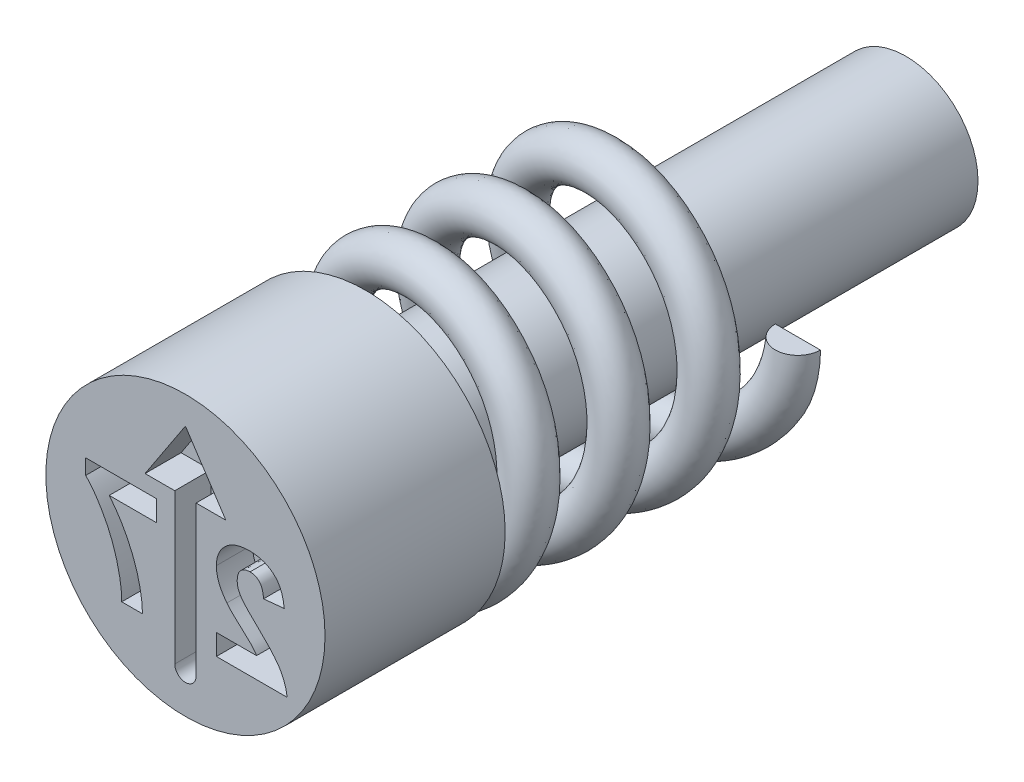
ISO-10303-21;
HEADER;
FILE_DESCRIPTION(('STEP AP214'),'2;1');
FILE_NAME('part.step','',(''),(''),'','','');
FILE_SCHEMA(('AUTOMOTIVE_DESIGN { 1 0 10303 214 1 1 1 1 }'));
ENDSEC;
DATA;
#1=APPLICATION_CONTEXT('core data for automotive mechanical design processes');
#2=APPLICATION_PROTOCOL_DEFINITION('international standard','automotive_design',2000,#1);
#3=PRODUCT_CONTEXT('',#1,'mechanical');
#4=PRODUCT('Part','Part','',(#3));
#5=PRODUCT_RELATED_PRODUCT_CATEGORY('part','',(#4));
#6=PRODUCT_DEFINITION_FORMATION('','',#4);
#7=PRODUCT_DEFINITION_CONTEXT('part definition',#1,'design');
#8=PRODUCT_DEFINITION('design','',#6,#7);
#9=PRODUCT_DEFINITION_SHAPE('','',#8);
#10=(LENGTH_UNIT() NAMED_UNIT(*) SI_UNIT(.MILLI.,.METRE.));
#11=(NAMED_UNIT(*) PLANE_ANGLE_UNIT() SI_UNIT($,.RADIAN.));
#12=(NAMED_UNIT(*) SI_UNIT($,.STERADIAN.) SOLID_ANGLE_UNIT());
#13=UNCERTAINTY_MEASURE_WITH_UNIT(LENGTH_MEASURE(1.E-05),#10,'distance_accuracy_value','');
#14=(GEOMETRIC_REPRESENTATION_CONTEXT(3) GLOBAL_UNCERTAINTY_ASSIGNED_CONTEXT((#13)) GLOBAL_UNIT_ASSIGNED_CONTEXT((#10,
#11,#12)) REPRESENTATION_CONTEXT('',''));
#15=CARTESIAN_POINT('',(0.,0.,0.));
#16=DIRECTION('',(0.,0.,1.));
#17=DIRECTION('',(1.,0.,0.));
#18=AXIS2_PLACEMENT_3D('',#15,#16,#17);
#19=CARTESIAN_POINT('',(1.3,0.,-5.75));
#20=DIRECTION('',(0.,-1.,0.));
#21=DIRECTION('',(0.,0.,-1.));
#22=AXIS2_PLACEMENT_3D('',#19,#20,#21);
#23=PLANE('',#22);
#24=CARTESIAN_POINT('',(1.3,0.,-5.5));
#25=DIRECTION('',(0.,1.,0.));
#26=DIRECTION('',(0.,0.,1.));
#27=AXIS2_PLACEMENT_3D('',#24,#25,#26);
#28=CIRCLE('',#27,0.25);
#29=CARTESIAN_POINT('',(1.05,0.,-5.5));
#30=VERTEX_POINT('',#29);
#31=CARTESIAN_POINT('',(1.55,0.,-5.5));
#32=VERTEX_POINT('',#31);
#33=EDGE_CURVE('E88',#30,#32,#28,.T.);
#34=ORIENTED_EDGE('',*,*,#33,.T.);
#35=DIRECTION('',(-1.,0.,0.));
#36=VECTOR('',#35,1.);
#37=CARTESIAN_POINT('',(1.3,0.,-5.5));
#38=LINE('',#37,#36);
#39=EDGE_CURVE('E75',#32,#30,#38,.T.);
#40=ORIENTED_EDGE('',*,*,#39,.T.);
#41=EDGE_LOOP('',(#34,#40));
#42=FACE_BOUND('',#41,.T.);
#43=ADVANCED_FACE('F49',(#42),#23,.F.);
#44=CARTESIAN_POINT('',(-1.3,0.,-2.25));
#45=DIRECTION('',(0.,1.,0.));
#46=DIRECTION('',(-1.,0.,0.));
#47=AXIS2_PLACEMENT_3D('',#44,#45,#46);
#48=PLANE('',#47);
#49=DIRECTION('',(-1.,0.,0.));
#50=VECTOR('',#49,1.);
#51=CARTESIAN_POINT('',(-1.3,0.,-2.));
#52=LINE('',#51,#50);
#53=CARTESIAN_POINT('',(-1.05,0.,-2.));
#54=VERTEX_POINT('',#53);
#55=CARTESIAN_POINT('',(-1.55,0.,-2.));
#56=VERTEX_POINT('',#55);
#57=EDGE_CURVE('E69',#54,#56,#52,.T.);
#58=ORIENTED_EDGE('',*,*,#57,.F.);
#59=CARTESIAN_POINT('',(-1.3,0.,-2.));
#60=DIRECTION('',(0.,1.,0.));
#61=DIRECTION('',(-1.,0.,0.));
#62=AXIS2_PLACEMENT_3D('',#59,#60,#61);
#63=CIRCLE('',#62,0.25);
#64=EDGE_CURVE('E85',#54,#56,#63,.T.);
#65=ORIENTED_EDGE('',*,*,#64,.T.);
#66=EDGE_LOOP('',(#58,#65));
#67=FACE_BOUND('',#66,.T.);
#68=ADVANCED_FACE('F51',(#67),#48,.T.);
#69=CARTESIAN_POINT('',(1.3,0.,-5.25));
#70=CARTESIAN_POINT('',(1.3,-0.538477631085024,-5.1875));
#71=CARTESIAN_POINT('',(0.919238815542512,-0.919238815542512,-5.125));
#72=CARTESIAN_POINT('',(0.538477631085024,-1.3,-5.0625));
#73=CARTESIAN_POINT('',(0.,-1.3,-5.));
#74=CARTESIAN_POINT('',(-0.538477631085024,-1.3,-4.9375));
#75=CARTESIAN_POINT('',(-0.919238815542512,-0.919238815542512,-4.875));
#76=CARTESIAN_POINT('',(-1.3,-0.538477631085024,-4.8125));
#77=CARTESIAN_POINT('',(-1.3,0.,-4.75));
#78=CARTESIAN_POINT('',(-1.3,0.538477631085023,-4.6875));
#79=CARTESIAN_POINT('',(-0.919238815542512,0.919238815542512,-4.625));
#80=CARTESIAN_POINT('',(-0.538477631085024,1.3,-4.5625));
#81=CARTESIAN_POINT('',(0.,1.3,-4.5));
#82=CARTESIAN_POINT('',(0.538477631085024,1.3,-4.4375));
#83=CARTESIAN_POINT('',(0.919238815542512,0.919238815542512,-4.375));
#84=CARTESIAN_POINT('',(1.3,0.538477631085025,-4.3125));
#85=CARTESIAN_POINT('',(1.3,0.,-4.25));
#86=CARTESIAN_POINT('',(1.3,-0.538477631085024,-4.1875));
#87=CARTESIAN_POINT('',(0.919238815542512,-0.919238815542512,-4.125));
#88=CARTESIAN_POINT('',(0.538477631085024,-1.3,-4.0625));
#89=CARTESIAN_POINT('',(0.,-1.3,-4.));
#90=CARTESIAN_POINT('',(-0.538477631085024,-1.3,-3.9375));
#91=CARTESIAN_POINT('',(-0.919238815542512,-0.919238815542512,-3.875));
#92=CARTESIAN_POINT('',(-1.3,-0.538477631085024,-3.8125));
#93=CARTESIAN_POINT('',(-1.3,0.,-3.75));
#94=CARTESIAN_POINT('',(-1.3,0.538477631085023,-3.6875));
#95=CARTESIAN_POINT('',(-0.919238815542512,0.919238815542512,-3.625));
#96=CARTESIAN_POINT('',(-0.538477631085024,1.3,-3.5625));
#97=CARTESIAN_POINT('',(0.,1.3,-3.5));
#98=CARTESIAN_POINT('',(0.538477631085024,1.3,-3.4375));
#99=CARTESIAN_POINT('',(0.919238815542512,0.919238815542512,-3.375));
#100=CARTESIAN_POINT('',(1.3,0.538477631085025,-3.3125));
#101=CARTESIAN_POINT('',(1.3,0.,-3.25));
#102=CARTESIAN_POINT('',(1.3,-0.538477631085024,-3.1875));
#103=CARTESIAN_POINT('',(0.919238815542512,-0.919238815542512,-3.125));
#104=CARTESIAN_POINT('',(0.538477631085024,-1.3,-3.0625));
#105=CARTESIAN_POINT('',(0.,-1.3,-3.));
#106=CARTESIAN_POINT('',(-0.538477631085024,-1.3,-2.9375));
#107=CARTESIAN_POINT('',(-0.919238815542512,-0.919238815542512,-2.875));
#108=CARTESIAN_POINT('',(-1.3,-0.538477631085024,-2.8125));
#109=CARTESIAN_POINT('',(-1.3,0.,-2.75));
#110=CARTESIAN_POINT('',(-1.3,0.538477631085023,-2.6875));
#111=CARTESIAN_POINT('',(-0.919238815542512,0.919238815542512,-2.625));
#112=CARTESIAN_POINT('',(-0.538477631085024,1.3,-2.5625));
#113=CARTESIAN_POINT('',(0.,1.3,-2.5));
#114=CARTESIAN_POINT('',(0.538477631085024,1.3,-2.4375));
#115=CARTESIAN_POINT('',(0.919238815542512,0.919238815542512,-2.375));
#116=CARTESIAN_POINT('',(1.3,0.538477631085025,-2.3125));
#117=CARTESIAN_POINT('',(1.3,0.,-2.25));
#118=CARTESIAN_POINT('',(1.3,-0.538477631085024,-2.1875));
#119=CARTESIAN_POINT('',(0.919238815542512,-0.919238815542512,-2.125));
#120=CARTESIAN_POINT('',(0.538477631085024,-1.3,-2.0625));
#121=CARTESIAN_POINT('',(0.,-1.3,-2.));
#122=CARTESIAN_POINT('',(-0.538477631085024,-1.3,-1.9375));
#123=CARTESIAN_POINT('',(-0.919238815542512,-0.919238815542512,-1.875));
#124=CARTESIAN_POINT('',(-1.3,-0.538477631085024,-1.8125));
#125=CARTESIAN_POINT('',(-1.3,0.,-1.75));
#126=CARTESIAN_POINT('',(1.8,0.,-5.25));
#127=CARTESIAN_POINT('',(1.8,-0.745584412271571,-5.1875));
#128=CARTESIAN_POINT('',(1.27279220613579,-1.27279220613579,-5.125));
#129=CARTESIAN_POINT('',(0.745584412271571,-1.8,-5.0625));
#130=CARTESIAN_POINT('',(0.,-1.8,-5.));
#131=CARTESIAN_POINT('',(-0.745584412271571,-1.8,-4.9375));
#132=CARTESIAN_POINT('',(-1.27279220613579,-1.27279220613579,-4.875));
#133=CARTESIAN_POINT('',(-1.8,-0.745584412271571,-4.8125));
#134=CARTESIAN_POINT('',(-1.8,0.,-4.75));
#135=CARTESIAN_POINT('',(-1.8,0.745584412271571,-4.6875));
#136=CARTESIAN_POINT('',(-1.27279220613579,1.27279220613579,-4.625));
#137=CARTESIAN_POINT('',(-0.745584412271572,1.8,-4.5625));
#138=CARTESIAN_POINT('',(0.,1.8,-4.5));
#139=CARTESIAN_POINT('',(0.745584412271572,1.8,-4.4375));
#140=CARTESIAN_POINT('',(1.27279220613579,1.27279220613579,-4.375));
#141=CARTESIAN_POINT('',(1.8,0.745584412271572,-4.3125));
#142=CARTESIAN_POINT('',(1.8,0.,-4.25));
#143=CARTESIAN_POINT('',(1.8,-0.745584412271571,-4.1875));
#144=CARTESIAN_POINT('',(1.27279220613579,-1.27279220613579,-4.125));
#145=CARTESIAN_POINT('',(0.745584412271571,-1.8,-4.0625));
#146=CARTESIAN_POINT('',(0.,-1.8,-4.));
#147=CARTESIAN_POINT('',(-0.745584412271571,-1.8,-3.9375));
#148=CARTESIAN_POINT('',(-1.27279220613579,-1.27279220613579,-3.875));
#149=CARTESIAN_POINT('',(-1.8,-0.745584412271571,-3.8125));
#150=CARTESIAN_POINT('',(-1.8,0.,-3.75));
#151=CARTESIAN_POINT('',(-1.8,0.745584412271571,-3.6875));
#152=CARTESIAN_POINT('',(-1.27279220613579,1.27279220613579,-3.625));
#153=CARTESIAN_POINT('',(-0.745584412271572,1.8,-3.5625));
#154=CARTESIAN_POINT('',(0.,1.8,-3.5));
#155=CARTESIAN_POINT('',(0.745584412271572,1.8,-3.4375));
#156=CARTESIAN_POINT('',(1.27279220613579,1.27279220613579,-3.375));
#157=CARTESIAN_POINT('',(1.8,0.745584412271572,-3.3125));
#158=CARTESIAN_POINT('',(1.8,0.,-3.25));
#159=CARTESIAN_POINT('',(1.8,-0.745584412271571,-3.1875));
#160=CARTESIAN_POINT('',(1.27279220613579,-1.27279220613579,-3.125));
#161=CARTESIAN_POINT('',(0.745584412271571,-1.8,-3.0625));
#162=CARTESIAN_POINT('',(0.,-1.8,-3.));
#163=CARTESIAN_POINT('',(-0.745584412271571,-1.8,-2.9375));
#164=CARTESIAN_POINT('',(-1.27279220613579,-1.27279220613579,-2.875));
#165=CARTESIAN_POINT('',(-1.8,-0.745584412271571,-2.8125));
#166=CARTESIAN_POINT('',(-1.8,0.,-2.75));
#167=CARTESIAN_POINT('',(-1.8,0.745584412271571,-2.6875));
#168=CARTESIAN_POINT('',(-1.27279220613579,1.27279220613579,-2.625));
#169=CARTESIAN_POINT('',(-0.745584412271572,1.8,-2.5625));
#170=CARTESIAN_POINT('',(0.,1.8,-2.5));
#171=CARTESIAN_POINT('',(0.745584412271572,1.8,-2.4375));
#172=CARTESIAN_POINT('',(1.27279220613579,1.27279220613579,-2.375));
#173=CARTESIAN_POINT('',(1.8,0.745584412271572,-2.3125));
#174=CARTESIAN_POINT('',(1.8,0.,-2.25));
#175=CARTESIAN_POINT('',(1.8,-0.745584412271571,-2.1875));
#176=CARTESIAN_POINT('',(1.27279220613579,-1.27279220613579,-2.125));
#177=CARTESIAN_POINT('',(0.745584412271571,-1.8,-2.0625));
#178=CARTESIAN_POINT('',(0.,-1.8,-2.));
#179=CARTESIAN_POINT('',(-0.745584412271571,-1.8,-1.9375));
#180=CARTESIAN_POINT('',(-1.27279220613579,-1.27279220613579,-1.875));
#181=CARTESIAN_POINT('',(-1.8,-0.745584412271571,-1.8125));
#182=CARTESIAN_POINT('',(-1.8,0.,-1.75));
#183=CARTESIAN_POINT('',(1.8,0.,-5.75));
#184=CARTESIAN_POINT('',(1.8,-0.745584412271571,-5.6875));
#185=CARTESIAN_POINT('',(1.27279220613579,-1.27279220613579,-5.625));
#186=CARTESIAN_POINT('',(0.745584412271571,-1.8,-5.5625));
#187=CARTESIAN_POINT('',(0.,-1.8,-5.5));
#188=CARTESIAN_POINT('',(-0.745584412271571,-1.8,-5.4375));
#189=CARTESIAN_POINT('',(-1.27279220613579,-1.27279220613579,-5.375));
#190=CARTESIAN_POINT('',(-1.8,-0.745584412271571,-5.3125));
#191=CARTESIAN_POINT('',(-1.8,0.,-5.25));
#192=CARTESIAN_POINT('',(-1.8,0.745584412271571,-5.1875));
#193=CARTESIAN_POINT('',(-1.27279220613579,1.27279220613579,-5.125));
#194=CARTESIAN_POINT('',(-0.745584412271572,1.8,-5.0625));
#195=CARTESIAN_POINT('',(0.,1.8,-5.));
#196=CARTESIAN_POINT('',(0.745584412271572,1.8,-4.9375));
#197=CARTESIAN_POINT('',(1.27279220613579,1.27279220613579,-4.875));
#198=CARTESIAN_POINT('',(1.8,0.745584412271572,-4.8125));
#199=CARTESIAN_POINT('',(1.8,0.,-4.75));
#200=CARTESIAN_POINT('',(1.8,-0.745584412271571,-4.6875));
#201=CARTESIAN_POINT('',(1.27279220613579,-1.27279220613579,-4.625));
#202=CARTESIAN_POINT('',(0.745584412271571,-1.8,-4.5625));
#203=CARTESIAN_POINT('',(0.,-1.8,-4.5));
#204=CARTESIAN_POINT('',(-0.745584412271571,-1.8,-4.4375));
#205=CARTESIAN_POINT('',(-1.27279220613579,-1.27279220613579,-4.375));
#206=CARTESIAN_POINT('',(-1.8,-0.745584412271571,-4.3125));
#207=CARTESIAN_POINT('',(-1.8,0.,-4.25));
#208=CARTESIAN_POINT('',(-1.8,0.745584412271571,-4.1875));
#209=CARTESIAN_POINT('',(-1.27279220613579,1.27279220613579,-4.125));
#210=CARTESIAN_POINT('',(-0.745584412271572,1.8,-4.0625));
#211=CARTESIAN_POINT('',(0.,1.8,-4.));
#212=CARTESIAN_POINT('',(0.745584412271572,1.8,-3.9375));
#213=CARTESIAN_POINT('',(1.27279220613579,1.27279220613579,-3.875));
#214=CARTESIAN_POINT('',(1.8,0.745584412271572,-3.8125));
#215=CARTESIAN_POINT('',(1.8,0.,-3.75));
#216=CARTESIAN_POINT('',(1.8,-0.745584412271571,-3.6875));
#217=CARTESIAN_POINT('',(1.27279220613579,-1.27279220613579,-3.625));
#218=CARTESIAN_POINT('',(0.745584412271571,-1.8,-3.5625));
#219=CARTESIAN_POINT('',(0.,-1.8,-3.5));
#220=CARTESIAN_POINT('',(-0.745584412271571,-1.8,-3.4375));
#221=CARTESIAN_POINT('',(-1.27279220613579,-1.27279220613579,-3.375));
#222=CARTESIAN_POINT('',(-1.8,-0.745584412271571,-3.3125));
#223=CARTESIAN_POINT('',(-1.8,0.,-3.25));
#224=CARTESIAN_POINT('',(-1.8,0.745584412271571,-3.1875));
#225=CARTESIAN_POINT('',(-1.27279220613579,1.27279220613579,-3.125));
#226=CARTESIAN_POINT('',(-0.745584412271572,1.8,-3.0625));
#227=CARTESIAN_POINT('',(0.,1.8,-3.));
#228=CARTESIAN_POINT('',(0.745584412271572,1.8,-2.9375));
#229=CARTESIAN_POINT('',(1.27279220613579,1.27279220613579,-2.875));
#230=CARTESIAN_POINT('',(1.8,0.745584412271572,-2.8125));
#231=CARTESIAN_POINT('',(1.8,0.,-2.75));
#232=CARTESIAN_POINT('',(1.8,-0.745584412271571,-2.6875));
#233=CARTESIAN_POINT('',(1.27279220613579,-1.27279220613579,-2.625));
#234=CARTESIAN_POINT('',(0.745584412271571,-1.8,-2.5625));
#235=CARTESIAN_POINT('',(0.,-1.8,-2.5));
#236=CARTESIAN_POINT('',(-0.745584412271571,-1.8,-2.4375));
#237=CARTESIAN_POINT('',(-1.27279220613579,-1.27279220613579,-2.375));
#238=CARTESIAN_POINT('',(-1.8,-0.745584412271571,-2.3125));
#239=CARTESIAN_POINT('',(-1.8,0.,-2.25));
#240=CARTESIAN_POINT('',(1.3,0.,-5.75));
#241=CARTESIAN_POINT('',(1.3,-0.538477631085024,-5.6875));
#242=CARTESIAN_POINT('',(0.919238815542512,-0.919238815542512,-5.625));
#243=CARTESIAN_POINT('',(0.538477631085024,-1.3,-5.5625));
#244=CARTESIAN_POINT('',(0.,-1.3,-5.5));
#245=CARTESIAN_POINT('',(-0.538477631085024,-1.3,-5.4375));
#246=CARTESIAN_POINT('',(-0.919238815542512,-0.919238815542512,-5.375));
#247=CARTESIAN_POINT('',(-1.3,-0.538477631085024,-5.3125));
#248=CARTESIAN_POINT('',(-1.3,0.,-5.25));
#249=CARTESIAN_POINT('',(-1.3,0.538477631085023,-5.1875));
#250=CARTESIAN_POINT('',(-0.919238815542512,0.919238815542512,-5.125));
#251=CARTESIAN_POINT('',(-0.538477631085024,1.3,-5.0625));
#252=CARTESIAN_POINT('',(0.,1.3,-5.));
#253=CARTESIAN_POINT('',(0.538477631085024,1.3,-4.9375));
#254=CARTESIAN_POINT('',(0.919238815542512,0.919238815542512,-4.875));
#255=CARTESIAN_POINT('',(1.3,0.538477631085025,-4.8125));
#256=CARTESIAN_POINT('',(1.3,0.,-4.75));
#257=CARTESIAN_POINT('',(1.3,-0.538477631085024,-4.6875));
#258=CARTESIAN_POINT('',(0.919238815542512,-0.919238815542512,-4.625));
#259=CARTESIAN_POINT('',(0.538477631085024,-1.3,-4.5625));
#260=CARTESIAN_POINT('',(0.,-1.3,-4.5));
#261=CARTESIAN_POINT('',(-0.538477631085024,-1.3,-4.4375));
#262=CARTESIAN_POINT('',(-0.919238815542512,-0.919238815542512,-4.375));
#263=CARTESIAN_POINT('',(-1.3,-0.538477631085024,-4.3125));
#264=CARTESIAN_POINT('',(-1.3,0.,-4.25));
#265=CARTESIAN_POINT('',(-1.3,0.538477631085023,-4.1875));
#266=CARTESIAN_POINT('',(-0.919238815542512,0.919238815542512,-4.125));
#267=CARTESIAN_POINT('',(-0.538477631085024,1.3,-4.0625));
#268=CARTESIAN_POINT('',(0.,1.3,-4.));
#269=CARTESIAN_POINT('',(0.538477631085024,1.3,-3.9375));
#270=CARTESIAN_POINT('',(0.919238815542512,0.919238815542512,-3.875));
#271=CARTESIAN_POINT('',(1.3,0.538477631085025,-3.8125));
#272=CARTESIAN_POINT('',(1.3,0.,-3.75));
#273=CARTESIAN_POINT('',(1.3,-0.538477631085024,-3.6875));
#274=CARTESIAN_POINT('',(0.919238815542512,-0.919238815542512,-3.625));
#275=CARTESIAN_POINT('',(0.538477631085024,-1.3,-3.5625));
#276=CARTESIAN_POINT('',(0.,-1.3,-3.5));
#277=CARTESIAN_POINT('',(-0.538477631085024,-1.3,-3.4375));
#278=CARTESIAN_POINT('',(-0.919238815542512,-0.919238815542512,-3.375));
#279=CARTESIAN_POINT('',(-1.3,-0.538477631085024,-3.3125));
#280=CARTESIAN_POINT('',(-1.3,0.,-3.25));
#281=CARTESIAN_POINT('',(-1.3,0.538477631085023,-3.1875));
#282=CARTESIAN_POINT('',(-0.919238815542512,0.919238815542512,-3.125));
#283=CARTESIAN_POINT('',(-0.538477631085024,1.3,-3.0625));
#284=CARTESIAN_POINT('',(0.,1.3,-3.));
#285=CARTESIAN_POINT('',(0.538477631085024,1.3,-2.9375));
#286=CARTESIAN_POINT('',(0.919238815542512,0.919238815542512,-2.875));
#287=CARTESIAN_POINT('',(1.3,0.538477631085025,-2.8125));
#288=CARTESIAN_POINT('',(1.3,0.,-2.75));
#289=CARTESIAN_POINT('',(1.3,-0.538477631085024,-2.6875));
#290=CARTESIAN_POINT('',(0.919238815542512,-0.919238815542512,-2.625));
#291=CARTESIAN_POINT('',(0.538477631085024,-1.3,-2.5625));
#292=CARTESIAN_POINT('',(0.,-1.3,-2.5));
#293=CARTESIAN_POINT('',(-0.538477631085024,-1.3,-2.4375));
#294=CARTESIAN_POINT('',(-0.919238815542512,-0.919238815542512,-2.375));
#295=CARTESIAN_POINT('',(-1.3,-0.538477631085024,-2.3125));
#296=CARTESIAN_POINT('',(-1.3,0.,-2.25));
#297=CARTESIAN_POINT('',(0.8,0.,-5.75));
#298=CARTESIAN_POINT('',(0.8,-0.331370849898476,-5.6875));
#299=CARTESIAN_POINT('',(0.565685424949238,-0.565685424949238,-5.625));
#300=CARTESIAN_POINT('',(0.331370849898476,-0.8,-5.5625));
#301=CARTESIAN_POINT('',(0.,-0.8,-5.5));
#302=CARTESIAN_POINT('',(-0.331370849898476,-0.8,-5.4375));
#303=CARTESIAN_POINT('',(-0.565685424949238,-0.565685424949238,-5.375));
#304=CARTESIAN_POINT('',(-0.8,-0.331370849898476,-5.3125));
#305=CARTESIAN_POINT('',(-0.8,0.,-5.25));
#306=CARTESIAN_POINT('',(-0.8,0.331370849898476,-5.1875));
#307=CARTESIAN_POINT('',(-0.565685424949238,0.565685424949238,-5.125));
#308=CARTESIAN_POINT('',(-0.331370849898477,0.8,-5.0625));
#309=CARTESIAN_POINT('',(0.,0.8,-5.));
#310=CARTESIAN_POINT('',(0.331370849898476,0.8,-4.9375));
#311=CARTESIAN_POINT('',(0.565685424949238,0.565685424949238,-4.875));
#312=CARTESIAN_POINT('',(0.8,0.331370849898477,-4.8125));
#313=CARTESIAN_POINT('',(0.8,0.,-4.75));
#314=CARTESIAN_POINT('',(0.8,-0.331370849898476,-4.6875));
#315=CARTESIAN_POINT('',(0.565685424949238,-0.565685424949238,-4.625));
#316=CARTESIAN_POINT('',(0.331370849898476,-0.8,-4.5625));
#317=CARTESIAN_POINT('',(0.,-0.8,-4.5));
#318=CARTESIAN_POINT('',(-0.331370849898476,-0.8,-4.4375));
#319=CARTESIAN_POINT('',(-0.565685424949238,-0.565685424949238,-4.375));
#320=CARTESIAN_POINT('',(-0.8,-0.331370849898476,-4.3125));
#321=CARTESIAN_POINT('',(-0.8,0.,-4.25));
#322=CARTESIAN_POINT('',(-0.8,0.331370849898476,-4.1875));
#323=CARTESIAN_POINT('',(-0.565685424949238,0.565685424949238,-4.125));
#324=CARTESIAN_POINT('',(-0.331370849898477,0.8,-4.0625));
#325=CARTESIAN_POINT('',(0.,0.8,-4.));
#326=CARTESIAN_POINT('',(0.331370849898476,0.8,-3.9375));
#327=CARTESIAN_POINT('',(0.565685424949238,0.565685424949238,-3.875));
#328=CARTESIAN_POINT('',(0.8,0.331370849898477,-3.8125));
#329=CARTESIAN_POINT('',(0.8,0.,-3.75));
#330=CARTESIAN_POINT('',(0.8,-0.331370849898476,-3.6875));
#331=CARTESIAN_POINT('',(0.565685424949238,-0.565685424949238,-3.625));
#332=CARTESIAN_POINT('',(0.331370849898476,-0.8,-3.5625));
#333=CARTESIAN_POINT('',(0.,-0.8,-3.5));
#334=CARTESIAN_POINT('',(-0.331370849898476,-0.8,-3.4375));
#335=CARTESIAN_POINT('',(-0.565685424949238,-0.565685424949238,-3.375));
#336=CARTESIAN_POINT('',(-0.8,-0.331370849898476,-3.3125));
#337=CARTESIAN_POINT('',(-0.8,0.,-3.25));
#338=CARTESIAN_POINT('',(-0.8,0.331370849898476,-3.1875));
#339=CARTESIAN_POINT('',(-0.565685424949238,0.565685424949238,-3.125));
#340=CARTESIAN_POINT('',(-0.331370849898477,0.8,-3.0625));
#341=CARTESIAN_POINT('',(0.,0.8,-3.));
#342=CARTESIAN_POINT('',(0.331370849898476,0.8,-2.9375));
#343=CARTESIAN_POINT('',(0.565685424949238,0.565685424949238,-2.875));
#344=CARTESIAN_POINT('',(0.8,0.331370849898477,-2.8125));
#345=CARTESIAN_POINT('',(0.8,0.,-2.75));
#346=CARTESIAN_POINT('',(0.8,-0.331370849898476,-2.6875));
#347=CARTESIAN_POINT('',(0.565685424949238,-0.565685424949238,-2.625));
#348=CARTESIAN_POINT('',(0.331370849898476,-0.8,-2.5625));
#349=CARTESIAN_POINT('',(0.,-0.8,-2.5));
#350=CARTESIAN_POINT('',(-0.331370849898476,-0.8,-2.4375));
#351=CARTESIAN_POINT('',(-0.565685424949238,-0.565685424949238,-2.375));
#352=CARTESIAN_POINT('',(-0.8,-0.331370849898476,-2.3125));
#353=CARTESIAN_POINT('',(-0.8,0.,-2.25));
#354=CARTESIAN_POINT('',(0.8,0.,-5.25));
#355=CARTESIAN_POINT('',(0.8,-0.331370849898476,-5.1875));
#356=CARTESIAN_POINT('',(0.565685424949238,-0.565685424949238,-5.125));
#357=CARTESIAN_POINT('',(0.331370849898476,-0.8,-5.0625));
#358=CARTESIAN_POINT('',(0.,-0.8,-5.));
#359=CARTESIAN_POINT('',(-0.331370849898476,-0.8,-4.9375));
#360=CARTESIAN_POINT('',(-0.565685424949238,-0.565685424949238,-4.875));
#361=CARTESIAN_POINT('',(-0.8,-0.331370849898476,-4.8125));
#362=CARTESIAN_POINT('',(-0.8,0.,-4.75));
#363=CARTESIAN_POINT('',(-0.8,0.331370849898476,-4.6875));
#364=CARTESIAN_POINT('',(-0.565685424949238,0.565685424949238,-4.625));
#365=CARTESIAN_POINT('',(-0.331370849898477,0.8,-4.5625));
#366=CARTESIAN_POINT('',(0.,0.8,-4.5));
#367=CARTESIAN_POINT('',(0.331370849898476,0.8,-4.4375));
#368=CARTESIAN_POINT('',(0.565685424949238,0.565685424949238,-4.375));
#369=CARTESIAN_POINT('',(0.8,0.331370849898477,-4.3125));
#370=CARTESIAN_POINT('',(0.8,0.,-4.25));
#371=CARTESIAN_POINT('',(0.8,-0.331370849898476,-4.1875));
#372=CARTESIAN_POINT('',(0.565685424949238,-0.565685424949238,-4.125));
#373=CARTESIAN_POINT('',(0.331370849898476,-0.8,-4.0625));
#374=CARTESIAN_POINT('',(0.,-0.8,-4.));
#375=CARTESIAN_POINT('',(-0.331370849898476,-0.8,-3.9375));
#376=CARTESIAN_POINT('',(-0.565685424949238,-0.565685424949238,-3.875));
#377=CARTESIAN_POINT('',(-0.8,-0.331370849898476,-3.8125));
#378=CARTESIAN_POINT('',(-0.8,0.,-3.75));
#379=CARTESIAN_POINT('',(-0.8,0.331370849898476,-3.6875));
#380=CARTESIAN_POINT('',(-0.565685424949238,0.565685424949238,-3.625));
#381=CARTESIAN_POINT('',(-0.331370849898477,0.8,-3.5625));
#382=CARTESIAN_POINT('',(0.,0.8,-3.5));
#383=CARTESIAN_POINT('',(0.331370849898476,0.8,-3.4375));
#384=CARTESIAN_POINT('',(0.565685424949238,0.565685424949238,-3.375));
#385=CARTESIAN_POINT('',(0.8,0.331370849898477,-3.3125));
#386=CARTESIAN_POINT('',(0.8,0.,-3.25));
#387=CARTESIAN_POINT('',(0.8,-0.331370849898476,-3.1875));
#388=CARTESIAN_POINT('',(0.565685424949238,-0.565685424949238,-3.125));
#389=CARTESIAN_POINT('',(0.331370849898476,-0.8,-3.0625));
#390=CARTESIAN_POINT('',(0.,-0.8,-3.));
#391=CARTESIAN_POINT('',(-0.331370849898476,-0.8,-2.9375));
#392=CARTESIAN_POINT('',(-0.565685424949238,-0.565685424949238,-2.875));
#393=CARTESIAN_POINT('',(-0.8,-0.331370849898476,-2.8125));
#394=CARTESIAN_POINT('',(-0.8,0.,-2.75));
#395=CARTESIAN_POINT('',(-0.8,0.331370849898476,-2.6875));
#396=CARTESIAN_POINT('',(-0.565685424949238,0.565685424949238,-2.625));
#397=CARTESIAN_POINT('',(-0.331370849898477,0.8,-2.5625));
#398=CARTESIAN_POINT('',(0.,0.8,-2.5));
#399=CARTESIAN_POINT('',(0.331370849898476,0.8,-2.4375));
#400=CARTESIAN_POINT('',(0.565685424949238,0.565685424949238,-2.375));
#401=CARTESIAN_POINT('',(0.8,0.331370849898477,-2.3125));
#402=CARTESIAN_POINT('',(0.8,0.,-2.25));
#403=CARTESIAN_POINT('',(0.8,-0.331370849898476,-2.1875));
#404=CARTESIAN_POINT('',(0.565685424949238,-0.565685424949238,-2.125));
#405=CARTESIAN_POINT('',(0.331370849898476,-0.8,-2.0625));
#406=CARTESIAN_POINT('',(0.,-0.8,-2.));
#407=CARTESIAN_POINT('',(-0.331370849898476,-0.8,-1.9375));
#408=CARTESIAN_POINT('',(-0.565685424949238,-0.565685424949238,-1.875));
#409=CARTESIAN_POINT('',(-0.8,-0.331370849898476,-1.8125));
#410=CARTESIAN_POINT('',(-0.8,0.,-1.75));
#411=CARTESIAN_POINT('',(1.3,0.,-5.25));
#412=CARTESIAN_POINT('',(1.3,-0.538477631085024,-5.1875));
#413=CARTESIAN_POINT('',(0.919238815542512,-0.919238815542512,-5.125));
#414=CARTESIAN_POINT('',(0.538477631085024,-1.3,-5.0625));
#415=CARTESIAN_POINT('',(0.,-1.3,-5.));
#416=CARTESIAN_POINT('',(-0.538477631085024,-1.3,-4.9375));
#417=CARTESIAN_POINT('',(-0.919238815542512,-0.919238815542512,-4.875));
#418=CARTESIAN_POINT('',(-1.3,-0.538477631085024,-4.8125));
#419=CARTESIAN_POINT('',(-1.3,0.,-4.75));
#420=CARTESIAN_POINT('',(-1.3,0.538477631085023,-4.6875));
#421=CARTESIAN_POINT('',(-0.919238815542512,0.919238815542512,-4.625));
#422=CARTESIAN_POINT('',(-0.538477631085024,1.3,-4.5625));
#423=CARTESIAN_POINT('',(0.,1.3,-4.5));
#424=CARTESIAN_POINT('',(0.538477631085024,1.3,-4.4375));
#425=CARTESIAN_POINT('',(0.919238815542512,0.919238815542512,-4.375));
#426=CARTESIAN_POINT('',(1.3,0.538477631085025,-4.3125));
#427=CARTESIAN_POINT('',(1.3,0.,-4.25));
#428=CARTESIAN_POINT('',(1.3,-0.538477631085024,-4.1875));
#429=CARTESIAN_POINT('',(0.919238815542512,-0.919238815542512,-4.125));
#430=CARTESIAN_POINT('',(0.538477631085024,-1.3,-4.0625));
#431=CARTESIAN_POINT('',(0.,-1.3,-4.));
#432=CARTESIAN_POINT('',(-0.538477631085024,-1.3,-3.9375));
#433=CARTESIAN_POINT('',(-0.919238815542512,-0.919238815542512,-3.875));
#434=CARTESIAN_POINT('',(-1.3,-0.538477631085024,-3.8125));
#435=CARTESIAN_POINT('',(-1.3,0.,-3.75));
#436=CARTESIAN_POINT('',(-1.3,0.538477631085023,-3.6875));
#437=CARTESIAN_POINT('',(-0.919238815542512,0.919238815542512,-3.625));
#438=CARTESIAN_POINT('',(-0.538477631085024,1.3,-3.5625));
#439=CARTESIAN_POINT('',(0.,1.3,-3.5));
#440=CARTESIAN_POINT('',(0.538477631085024,1.3,-3.4375));
#441=CARTESIAN_POINT('',(0.919238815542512,0.919238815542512,-3.375));
#442=CARTESIAN_POINT('',(1.3,0.538477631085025,-3.3125));
#443=CARTESIAN_POINT('',(1.3,0.,-3.25));
#444=CARTESIAN_POINT('',(1.3,-0.538477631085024,-3.1875));
#445=CARTESIAN_POINT('',(0.919238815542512,-0.919238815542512,-3.125));
#446=CARTESIAN_POINT('',(0.538477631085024,-1.3,-3.0625));
#447=CARTESIAN_POINT('',(0.,-1.3,-3.));
#448=CARTESIAN_POINT('',(-0.538477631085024,-1.3,-2.9375));
#449=CARTESIAN_POINT('',(-0.919238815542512,-0.919238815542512,-2.875));
#450=CARTESIAN_POINT('',(-1.3,-0.538477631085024,-2.8125));
#451=CARTESIAN_POINT('',(-1.3,0.,-2.75));
#452=CARTESIAN_POINT('',(-1.3,0.538477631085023,-2.6875));
#453=CARTESIAN_POINT('',(-0.919238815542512,0.919238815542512,-2.625));
#454=CARTESIAN_POINT('',(-0.538477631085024,1.3,-2.5625));
#455=CARTESIAN_POINT('',(0.,1.3,-2.5));
#456=CARTESIAN_POINT('',(0.538477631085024,1.3,-2.4375));
#457=CARTESIAN_POINT('',(0.919238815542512,0.919238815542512,-2.375));
#458=CARTESIAN_POINT('',(1.3,0.538477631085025,-2.3125));
#459=CARTESIAN_POINT('',(1.3,0.,-2.25));
#460=CARTESIAN_POINT('',(1.3,-0.538477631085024,-2.1875));
#461=CARTESIAN_POINT('',(0.919238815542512,-0.919238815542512,-2.125));
#462=CARTESIAN_POINT('',(0.538477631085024,-1.3,-2.0625));
#463=CARTESIAN_POINT('',(0.,-1.3,-2.));
#464=CARTESIAN_POINT('',(-0.538477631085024,-1.3,-1.9375));
#465=CARTESIAN_POINT('',(-0.919238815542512,-0.919238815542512,-1.875));
#466=CARTESIAN_POINT('',(-1.3,-0.538477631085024,-1.8125));
#467=CARTESIAN_POINT('',(-1.3,0.,-1.75));
#468=(BOUNDED_SURFACE() B_SPLINE_SURFACE(3,2,((#69,#70,#71,#72,#73,#74,#75,#76,#77,#78,#79,#80,
#81,#82,#83,#84,#85,#86,#87,#88,#89,#90,#91,#92,#93,#94,#95,#96,#97,#98,#99,#100,#101,#102,#103,
#104,#105,#106,#107,#108,#109,#110,#111,#112,#113,#114,#115,#116,#117,#118,#119,#120,#121,#122,
#123,#124,#125),(#126,#127,#128,#129,#130,#131,#132,#133,#134,#135,#136,#137,#138,#139,#140,
#141,#142,#143,#144,#145,#146,#147,#148,#149,#150,#151,#152,#153,#154,#155,#156,#157,#158,#159,
#160,#161,#162,#163,#164,#165,#166,#167,#168,#169,#170,#171,#172,#173,#174,#175,#176,#177,#178,
#179,#180,#181,#182),(#183,#184,#185,#186,#187,#188,#189,#190,#191,#192,#193,#194,#195,#196,
#197,#198,#199,#200,#201,#202,#203,#204,#205,#206,#207,#208,#209,#210,#211,#212,#213,#214,#215,
#216,#217,#218,#219,#220,#221,#222,#223,#224,#225,#226,#227,#228,#229,#230,#231,#232,#233,#234,
#235,#236,#237,#238,#239),(#240,#241,#242,#243,#244,#245,#246,#247,#248,#249,#250,#251,#252,
#253,#254,#255,#256,#257,#258,#259,#260,#261,#262,#263,#264,#265,#266,#267,#268,#269,#270,#271,
#272,#273,#274,#275,#276,#277,#278,#279,#280,#281,#282,#283,#284,#285,#286,#287,#288,#289,#290,
#291,#292,#293,#294,#295,#296),(#297,#298,#299,#300,#301,#302,#303,#304,#305,#306,#307,#308,
#309,#310,#311,#312,#313,#314,#315,#316,#317,#318,#319,#320,#321,#322,#323,#324,#325,#326,#327,
#328,#329,#330,#331,#332,#333,#334,#335,#336,#337,#338,#339,#340,#341,#342,#343,#344,#345,#346,
#347,#348,#349,#350,#351,#352,#353),(#354,#355,#356,#357,#358,#359,#360,#361,#362,#363,#364,
#365,#366,#367,#368,#369,#370,#371,#372,#373,#374,#375,#376,#377,#378,#379,#380,#381,#382,#383,
#384,#385,#386,#387,#388,#389,#390,#391,#392,#393,#394,#395,#396,#397,#398,#399,#400,#401,#402,
#403,#404,#405,#406,#407,#408,#409,#410),(#411,#412,#413,#414,#415,#416,#417,#418,#419,#420,
#421,#422,#423,#424,#425,#426,#427,#428,#429,#430,#431,#432,#433,#434,#435,#436,#437,#438,#439,
#440,#441,#442,#443,#444,#445,#446,#447,#448,#449,#450,#451,#452,#453,#454,#455,#456,#457,#458,
#459,#460,#461,#462,#463,#464,#465,#466,#467)),.UNSPECIFIED.,.T.,.F.,
.F.) B_SPLINE_SURFACE_WITH_KNOTS((4,3,4),(3,2,2,2,2,2,2,2,2,2,2,2,2,2,2,2,2,2,2,2,2,2,2,2,2,2,2,
2,3),(0.,0.5,1.),(0.,0.03125,0.0625,0.09375,0.125,0.15625,0.1875,0.21875,0.25,0.28125,0.3125,
0.34375,0.375,0.40625,0.4375,0.46875,0.5,0.53125,0.5625,0.59375,0.625,0.65625,0.6875,0.71875,
0.75,0.78125,0.8125,0.84375,0.875),
.UNSPECIFIED.) GEOMETRIC_REPRESENTATION_ITEM() RATIONAL_B_SPLINE_SURFACE(((1.,0.923879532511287,
1.,0.923879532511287,1.,0.923879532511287,1.,0.923879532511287,1.,0.923879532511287,1.,
0.923879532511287,1.,0.923879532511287,1.,0.923879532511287,1.,0.923879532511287,1.,
0.923879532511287,1.,0.923879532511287,1.,0.923879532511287,1.,0.923879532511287,1.,
0.923879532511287,1.,0.923879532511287,1.,0.923879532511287,1.,0.923879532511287,1.,
0.923879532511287,1.,0.923879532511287,1.,0.923879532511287,1.,0.923879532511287,1.,
0.923879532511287,1.,0.923879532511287,1.,0.923879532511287,1.,0.923879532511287,1.,
0.923879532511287,1.,0.923879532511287,1.,0.923879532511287,1.),(0.333333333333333,
0.307959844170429,0.333333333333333,0.307959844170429,0.333333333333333,0.307959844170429,
0.333333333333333,0.307959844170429,0.333333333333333,0.307959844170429,0.333333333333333,
0.307959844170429,0.333333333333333,0.307959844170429,0.333333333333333,0.307959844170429,
0.333333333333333,0.307959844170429,0.333333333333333,0.307959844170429,0.333333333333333,
0.307959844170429,0.333333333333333,0.307959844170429,0.333333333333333,0.307959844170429,
0.333333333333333,0.307959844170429,0.333333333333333,0.307959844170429,0.333333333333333,
0.307959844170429,0.333333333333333,0.307959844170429,0.333333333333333,0.307959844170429,
0.333333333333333,0.307959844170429,0.333333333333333,0.307959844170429,0.333333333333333,
0.307959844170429,0.333333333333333,0.307959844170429,0.333333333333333,0.307959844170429,
0.333333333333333,0.307959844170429,0.333333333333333,0.307959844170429,0.333333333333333,
0.307959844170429,0.333333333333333,0.307959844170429,0.333333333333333,0.307959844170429,
0.333333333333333),(0.333333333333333,0.307959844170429,0.333333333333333,0.307959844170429,
0.333333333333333,0.307959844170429,0.333333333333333,0.307959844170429,0.333333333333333,
0.307959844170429,0.333333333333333,0.307959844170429,0.333333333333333,0.307959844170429,
0.333333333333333,0.307959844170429,0.333333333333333,0.307959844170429,0.333333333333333,
0.307959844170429,0.333333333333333,0.307959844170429,0.333333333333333,0.307959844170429,
0.333333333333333,0.307959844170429,0.333333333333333,0.307959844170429,0.333333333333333,
0.307959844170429,0.333333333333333,0.307959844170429,0.333333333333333,0.307959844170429,
0.333333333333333,0.307959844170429,0.333333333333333,0.307959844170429,0.333333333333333,
0.307959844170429,0.333333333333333,0.307959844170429,0.333333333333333,0.307959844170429,
0.333333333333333,0.307959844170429,0.333333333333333,0.307959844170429,0.333333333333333,
0.307959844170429,0.333333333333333,0.307959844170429,0.333333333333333,0.307959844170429,
0.333333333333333,0.307959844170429,0.333333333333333),(1.,0.923879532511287,1.,
0.923879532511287,1.,0.923879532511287,1.,0.923879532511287,1.,0.923879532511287,1.,
0.923879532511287,1.,0.923879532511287,1.,0.923879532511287,1.,0.923879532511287,1.,
0.923879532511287,1.,0.923879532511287,1.,0.923879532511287,1.,0.923879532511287,1.,
0.923879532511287,1.,0.923879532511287,1.,0.923879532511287,1.,0.923879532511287,1.,
0.923879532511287,1.,0.923879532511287,1.,0.923879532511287,1.,0.923879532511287,1.,
0.923879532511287,1.,0.923879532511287,1.,0.923879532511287,1.,0.923879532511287,1.,
0.923879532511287,1.,0.923879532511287,1.,0.923879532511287,1.),(0.333333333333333,
0.307959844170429,0.333333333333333,0.307959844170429,0.333333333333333,0.307959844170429,
0.333333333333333,0.307959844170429,0.333333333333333,0.307959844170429,0.333333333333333,
0.307959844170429,0.333333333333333,0.307959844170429,0.333333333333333,0.307959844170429,
0.333333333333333,0.307959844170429,0.333333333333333,0.307959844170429,0.333333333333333,
0.307959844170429,0.333333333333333,0.307959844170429,0.333333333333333,0.307959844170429,
0.333333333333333,0.307959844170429,0.333333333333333,0.307959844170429,0.333333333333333,
0.307959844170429,0.333333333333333,0.307959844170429,0.333333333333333,0.307959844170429,
0.333333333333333,0.307959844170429,0.333333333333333,0.307959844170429,0.333333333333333,
0.307959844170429,0.333333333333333,0.307959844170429,0.333333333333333,0.307959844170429,
0.333333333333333,0.307959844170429,0.333333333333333,0.307959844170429,0.333333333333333,
0.307959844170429,0.333333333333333,0.307959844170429,0.333333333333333,0.307959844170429,
0.333333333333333),(0.333333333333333,0.307959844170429,0.333333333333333,0.307959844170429,
0.333333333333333,0.307959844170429,0.333333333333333,0.307959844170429,0.333333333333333,
0.307959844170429,0.333333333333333,0.307959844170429,0.333333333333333,0.307959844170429,
0.333333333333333,0.307959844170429,0.333333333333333,0.307959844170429,0.333333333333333,
0.307959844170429,0.333333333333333,0.307959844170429,0.333333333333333,0.307959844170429,
0.333333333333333,0.307959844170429,0.333333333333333,0.307959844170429,0.333333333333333,
0.307959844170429,0.333333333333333,0.307959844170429,0.333333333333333,0.307959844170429,
0.333333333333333,0.307959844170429,0.333333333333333,0.307959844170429,0.333333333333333,
0.307959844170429,0.333333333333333,0.307959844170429,0.333333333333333,0.307959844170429,
0.333333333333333,0.307959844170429,0.333333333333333,0.307959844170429,0.333333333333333,
0.307959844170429,0.333333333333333,0.307959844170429,0.333333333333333,0.307959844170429,
0.333333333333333,0.307959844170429,0.333333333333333),(1.,0.923879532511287,1.,
0.923879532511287,1.,0.923879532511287,1.,0.923879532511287,1.,0.923879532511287,1.,
0.923879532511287,1.,0.923879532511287,1.,0.923879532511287,1.,0.923879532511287,1.,
0.923879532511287,1.,0.923879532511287,1.,0.923879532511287,1.,0.923879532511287,1.,
0.923879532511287,1.,0.923879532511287,1.,0.923879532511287,1.,0.923879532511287,1.,
0.923879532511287,1.,0.923879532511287,1.,0.923879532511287,1.,0.923879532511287,1.,
0.923879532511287,1.,0.923879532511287,1.,0.923879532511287,1.,0.923879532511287,1.,
0.923879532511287,1.,0.923879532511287,1.,0.923879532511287,1.))) REPRESENTATION_ITEM('') SURFACE());
#469=CARTESIAN_POINT('',(1.05,0.,-5.5));
#470=CARTESIAN_POINT('',(1.05004023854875,-0.065567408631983,-5.5));
#471=CARTESIAN_POINT('',(1.04439509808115,-0.131091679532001,-5.5));
#472=CARTESIAN_POINT('',(1.02231800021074,-0.260106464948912,-5.5));
#473=CARTESIAN_POINT('',(1.00591764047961,-0.323602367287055,-5.5));
#474=CARTESIAN_POINT('',(0.962903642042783,-0.447028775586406,-5.5));
#475=CARTESIAN_POINT('',(0.936288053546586,-0.506958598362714,-5.5));
#476=CARTESIAN_POINT('',(0.873593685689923,-0.621757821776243,-5.5));
#477=CARTESIAN_POINT('',(0.837506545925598,-0.676622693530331,-5.5));
#478=CARTESIAN_POINT('',(0.77655938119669,-0.754465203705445,-5.5));
#479=CARTESIAN_POINT('',(0.754811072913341,-0.779941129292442,-5.5));
#480=CARTESIAN_POINT('',(0.709428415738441,-0.829161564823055,-5.5));
#481=CARTESIAN_POINT('',(0.68579390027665,-0.852905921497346,-5.5));
#482=CARTESIAN_POINT('',(0.636876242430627,-0.898528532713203,-5.5));
#483=CARTESIAN_POINT('',(0.611596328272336,-0.920410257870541,-5.50000000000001));
#484=CARTESIAN_POINT('',(0.55955004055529,-0.962330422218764,-5.49999999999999));
#485=CARTESIAN_POINT('',(0.532783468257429,-0.982368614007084,-5.49999999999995));
#486=CARTESIAN_POINT('',(0.474625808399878,-1.02294574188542,-5.49999999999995));
#487=CARTESIAN_POINT('',(0.443069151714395,-1.0432469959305,-5.49999999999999));
#488=CARTESIAN_POINT('',(0.378684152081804,-1.08165783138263,-5.50000000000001));
#489=CARTESIAN_POINT('',(0.34585658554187,-1.0997687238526,-5.49999999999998));
#490=CARTESIAN_POINT('',(0.279249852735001,-1.13413514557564,-5.50000000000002));
#491=CARTESIAN_POINT('',(0.245470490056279,-1.15039028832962,-5.50000000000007));
#492=CARTESIAN_POINT('',(0.194442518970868,-1.17406361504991,-5.49999999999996));
#493=CARTESIAN_POINT('',(0.177356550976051,-1.181843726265,-5.4999999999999));
#494=CARTESIAN_POINT('',(0.143194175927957,-1.19741723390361,-5.5000000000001));
#495=CARTESIAN_POINT('',(0.126117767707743,-1.2052106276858,-5.50000000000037));
#496=CARTESIAN_POINT('',(0.097135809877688,-1.21897868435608,-5.4999999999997));
#497=CARTESIAN_POINT('',(0.0851707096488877,-1.22482314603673,-5.49999999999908));
#498=CARTESIAN_POINT('',(0.0675074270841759,-1.23410189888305,-5.50000000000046));
#499=CARTESIAN_POINT('',(0.0616740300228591,-1.23727596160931,-5.5000000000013));
#500=CARTESIAN_POINT('',(0.0501655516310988,-1.24389672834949,-5.4999999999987));
#501=CARTESIAN_POINT('',(0.0444903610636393,-1.24734323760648,-5.49999999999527));
#502=CARTESIAN_POINT('',(0.0333338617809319,-1.25473509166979,-5.49999999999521));
#503=CARTESIAN_POINT('',(0.0278573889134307,-1.25868782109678,-5.4999999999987));
#504=CARTESIAN_POINT('',(0.0175458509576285,-1.26732506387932,-5.50000000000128));
#505=CARTESIAN_POINT('',(0.012704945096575,-1.27200190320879,-5.50000000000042));
#506=CARTESIAN_POINT('',(0.0059212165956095,-1.28099175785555,-5.49999999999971));
#507=CARTESIAN_POINT('',(0.00354675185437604,-1.28494182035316,-5.49999999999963));
#508=CARTESIAN_POINT('',(0.000796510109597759,-1.29247828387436,-5.50000000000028));
#509=CARTESIAN_POINT('',(7.79755926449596E-05,-1.29592472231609,-5.50000000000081));
#510=CARTESIAN_POINT('',(-6.5274644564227E-05,-1.30286100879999,-5.49999999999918));
#511=CARTESIAN_POINT('',(0.000513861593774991,-1.30635095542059,-5.49999999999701));
#512=CARTESIAN_POINT('',(0.00300622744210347,-1.31380427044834,-5.49999999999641));
#513=CARTESIAN_POINT('',(0.00522788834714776,-1.3176538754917,-5.4999999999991));
#514=CARTESIAN_POINT('',(0.0101313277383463,-1.32417868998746,-5.50000000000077));
#515=CARTESIAN_POINT('',(0.0127082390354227,-1.32694255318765,-5.50000000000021));
#516=CARTESIAN_POINT('',(0.0182244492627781,-1.33209256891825,-5.49999999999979));
#517=CARTESIAN_POINT('',(0.0211647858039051,-1.33447759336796,-5.49999999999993));
#518=CARTESIAN_POINT('',(0.0285488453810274,-1.33989164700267,-5.50000000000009));
#519=CARTESIAN_POINT('',(0.0331026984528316,-1.34276677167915,-5.50000000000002));
#520=CARTESIAN_POINT('',(0.042460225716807,-1.34808354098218,-5.49999999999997));
#521=CARTESIAN_POINT('',(0.0472643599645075,-1.35052434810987,-5.49999999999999));
#522=CARTESIAN_POINT('',(0.0619457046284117,-1.35736545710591,-5.50000000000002));
#523=CARTESIAN_POINT('',(0.0720556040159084,-1.36126112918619,-5.50000000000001));
#524=CARTESIAN_POINT('',(0.0972888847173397,-1.36974121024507,-5.49999999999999));
#525=CARTESIAN_POINT('',(0.112575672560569,-1.37381572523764,-5.5));
#526=CARTESIAN_POINT('',(0.143457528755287,-1.38061388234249,-5.5));
#527=CARTESIAN_POINT('',(0.159053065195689,-1.38333527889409,-5.5));
#528=CARTESIAN_POINT('',(0.206067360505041,-1.38986942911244,-5.5));
#529=CARTESIAN_POINT('',(0.237714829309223,-1.39205243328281,-5.5));
#530=CARTESIAN_POINT('',(0.297580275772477,-1.39298687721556,-5.5));
#531=CARTESIAN_POINT('',(0.325797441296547,-1.3920852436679,-5.5));
#532=CARTESIAN_POINT('',(0.382068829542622,-1.38789906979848,-5.5));
#533=CARTESIAN_POINT('',(0.410122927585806,-1.38461289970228,-5.5));
#534=CARTESIAN_POINT('',(0.493742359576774,-1.37149669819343,-5.5));
#535=CARTESIAN_POINT('',(0.548817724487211,-1.35840893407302,-5.5));
#536=CARTESIAN_POINT('',(0.659113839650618,-1.32380814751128,-5.5));
#537=CARTESIAN_POINT('',(0.714214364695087,-1.30192043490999,-5.5));
#538=CARTESIAN_POINT('',(0.820816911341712,-1.25066508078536,-5.5));
#539=CARTESIAN_POINT('',(0.872319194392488,-1.22129798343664,-5.5));
#540=CARTESIAN_POINT('',(0.951039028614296,-1.16910877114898,-5.5));
#541=CARTESIAN_POINT('',(0.979689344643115,-1.1484081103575,-5.5));
#542=CARTESIAN_POINT('',(1.03522901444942,-1.10481371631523,-5.5));
#543=CARTESIAN_POINT('',(1.0621197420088,-1.08192172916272,-5.5));
#544=CARTESIAN_POINT('',(1.14014024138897,-1.0102732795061,-5.5));
#545=CARTESIAN_POINT('',(1.18859870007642,-0.95855756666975,-5.49999999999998));
#546=CARTESIAN_POINT('',(1.28158465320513,-0.843172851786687,-5.50000000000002));
#547=CARTESIAN_POINT('',(1.32527713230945,-0.778831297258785,-5.50000000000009));
#548=CARTESIAN_POINT('',(1.40165140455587,-0.643915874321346,-5.49999999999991));
#549=CARTESIAN_POINT('',(1.43433050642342,-0.573340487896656,-5.49999999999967));
#550=CARTESIAN_POINT('',(1.49049812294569,-0.420680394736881,-5.49999999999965));
#551=CARTESIAN_POINT('',(1.51277935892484,-0.338144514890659,-5.49999999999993));
#552=CARTESIAN_POINT('',(1.53509699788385,-0.212413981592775,-5.50000000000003));
#553=CARTESIAN_POINT('',(1.54068551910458,-0.170128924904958,-5.50000000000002));
#554=CARTESIAN_POINT('',(1.54813644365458,-0.085236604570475,-5.49999999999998));
#555=CARTESIAN_POINT('',(1.54999929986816,-0.0426293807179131,-5.49999999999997));
#556=CARTESIAN_POINT('',(1.55,0.,-5.5));
#557=B_SPLINE_CURVE_WITH_KNOTS('',3,(#469,#470,#471,#472,#473,#474,#475,#476,#477,#478,#479,
#480,#481,#482,#483,#484,#485,#486,#487,#488,#489,#490,#491,#492,#493,#494,#495,#496,#497,#498,
#499,#500,#501,#502,#503,#504,#505,#506,#507,#508,#509,#510,#511,#512,#513,#514,#515,#516,#517,
#518,#519,#520,#521,#522,#523,#524,#525,#526,#527,#528,#529,#530,#531,#532,#533,#534,#535,#536,
#537,#538,#539,#540,#541,#542,#543,#544,#545,#546,#547,#548,#549,#550,#551,#552,#553,#554,#555,
#556),.UNSPECIFIED.,.F.,.F.,(4,2,2,2,2,2,2,2,2,2,2,2,2,2,2,2,2,2,2,2,2,2,2,2,2,2,2,2,2,2,2,2,2,
2,2,2,2,2,2,2,2,2,2,4),(0.,0.19640139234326,0.392228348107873,0.588092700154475,
0.784130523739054,0.884529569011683,0.984937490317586,1.08515402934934,1.18538399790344,
1.29785399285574,1.4102563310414,1.52268203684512,1.5790047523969,1.6353173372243,
1.67525333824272,1.69517261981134,1.71507778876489,1.73531616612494,1.75535313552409,
1.76897470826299,1.77932961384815,1.7897152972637,1.80280846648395,1.81410624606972,
1.82543706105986,1.84155724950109,1.857708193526,1.89013811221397,1.9375125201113,
1.98496528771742,2.07986766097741,2.16446347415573,2.24911716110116,2.41826767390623,
2.59554760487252,2.7728146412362,2.87875081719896,2.98460327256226,3.19637847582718,
3.42866036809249,3.66099898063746,3.91599867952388,4.04381665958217,4.17161910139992),.UNSPECIFIED.);
#558=EDGE_CURVE('E63',#30,#32,#557,.T.);
#559=CARTESIAN_POINT('',(-1.05,0.,-2.));
#560=CARTESIAN_POINT('',(-1.05004023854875,-0.0655674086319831,-2.));
#561=CARTESIAN_POINT('',(-1.04439509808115,-0.131091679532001,-2.));
#562=CARTESIAN_POINT('',(-1.02231800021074,-0.260106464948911,-2.));
#563=CARTESIAN_POINT('',(-1.00591764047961,-0.323602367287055,-2.));
#564=CARTESIAN_POINT('',(-0.962903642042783,-0.447028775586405,-2.));
#565=CARTESIAN_POINT('',(-0.936288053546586,-0.506958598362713,-2.));
#566=CARTESIAN_POINT('',(-0.873593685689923,-0.621757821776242,-2.));
#567=CARTESIAN_POINT('',(-0.837506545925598,-0.676622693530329,-2.));
#568=CARTESIAN_POINT('',(-0.776559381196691,-0.754465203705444,-2.));
#569=CARTESIAN_POINT('',(-0.754811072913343,-0.779941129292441,-2.));
#570=CARTESIAN_POINT('',(-0.709428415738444,-0.829161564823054,-2.));
#571=CARTESIAN_POINT('',(-0.685793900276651,-0.852905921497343,-2.));
#572=CARTESIAN_POINT('',(-0.636876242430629,-0.8985285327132,-2.));
#573=CARTESIAN_POINT('',(-0.611596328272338,-0.920410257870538,-1.99999999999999));
#574=CARTESIAN_POINT('',(-0.559550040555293,-0.962330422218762,-2.00000000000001));
#575=CARTESIAN_POINT('',(-0.532783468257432,-0.982368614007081,-2.00000000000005));
#576=CARTESIAN_POINT('',(-0.474625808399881,-1.02294574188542,-2.00000000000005));
#577=CARTESIAN_POINT('',(-0.4430691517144,-1.0432469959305,-2.00000000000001));
#578=CARTESIAN_POINT('',(-0.378684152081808,-1.08165783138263,-1.99999999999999));
#579=CARTESIAN_POINT('',(-0.345856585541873,-1.09976872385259,-2.00000000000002));
#580=CARTESIAN_POINT('',(-0.279249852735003,-1.13413514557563,-1.99999999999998));
#581=CARTESIAN_POINT('',(-0.245470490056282,-1.15039028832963,-1.99999999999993));
#582=CARTESIAN_POINT('',(-0.19444251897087,-1.17406361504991,-2.00000000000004));
#583=CARTESIAN_POINT('',(-0.177356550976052,-1.181843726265,-2.0000000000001));
#584=CARTESIAN_POINT('',(-0.143194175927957,-1.1974172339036,-1.9999999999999));
#585=CARTESIAN_POINT('',(-0.126117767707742,-1.2052106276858,-1.99999999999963));
#586=CARTESIAN_POINT('',(-0.0971358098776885,-1.21897868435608,-2.0000000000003));
#587=CARTESIAN_POINT('',(-0.0851707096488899,-1.22482314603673,-2.00000000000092));
#588=CARTESIAN_POINT('',(-0.0675074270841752,-1.23410189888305,-1.99999999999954));
#589=CARTESIAN_POINT('',(-0.0616740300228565,-1.23727596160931,-1.9999999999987));
#590=CARTESIAN_POINT('',(-0.0501655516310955,-1.24389672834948,-2.0000000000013));
#591=CARTESIAN_POINT('',(-0.0444903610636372,-1.24734323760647,-2.00000000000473));
#592=CARTESIAN_POINT('',(-0.0333338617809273,-1.25473509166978,-2.00000000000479));
#593=CARTESIAN_POINT('',(-0.0278573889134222,-1.25868782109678,-2.0000000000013));
#594=CARTESIAN_POINT('',(-0.0175458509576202,-1.26732506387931,-1.99999999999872));
#595=CARTESIAN_POINT('',(-0.0127049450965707,-1.27200190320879,-1.99999999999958));
#596=CARTESIAN_POINT('',(-0.00592121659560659,-1.28099175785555,-2.00000000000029));
#597=CARTESIAN_POINT('',(-0.00354675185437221,-1.28494182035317,-2.00000000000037));
#598=CARTESIAN_POINT('',(-0.000796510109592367,-1.29247828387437,-1.99999999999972));
#599=CARTESIAN_POINT('',(-7.79755926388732E-05,-1.2959247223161,-1.99999999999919));
#600=CARTESIAN_POINT('',(6.52746445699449E-05,-1.30286100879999,-2.00000000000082));
#601=CARTESIAN_POINT('',(-0.000513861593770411,-1.3063509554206,-2.00000000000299));
#602=CARTESIAN_POINT('',(-0.00300622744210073,-1.31380427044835,-2.00000000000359));
#603=CARTESIAN_POINT('',(-0.00522788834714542,-1.31765387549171,-2.0000000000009));
#604=CARTESIAN_POINT('',(-0.0101313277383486,-1.32417868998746,-1.99999999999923));
#605=CARTESIAN_POINT('',(-0.012708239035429,-1.32694255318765,-1.99999999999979));
#606=CARTESIAN_POINT('',(-0.0182244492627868,-1.33209256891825,-2.00000000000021));
#607=CARTESIAN_POINT('',(-0.0211647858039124,-1.33447759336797,-2.00000000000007));
#608=CARTESIAN_POINT('',(-0.0285488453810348,-1.33989164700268,-1.99999999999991));
#609=CARTESIAN_POINT('',(-0.0331026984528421,-1.34276677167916,-1.99999999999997));
#610=CARTESIAN_POINT('',(-0.0424602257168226,-1.34808354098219,-2.00000000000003));
#611=CARTESIAN_POINT('',(-0.0472643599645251,-1.35052434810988,-2.00000000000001));
#612=CARTESIAN_POINT('',(-0.0619457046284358,-1.35736545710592,-1.99999999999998));
#613=CARTESIAN_POINT('',(-0.0720556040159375,-1.3612611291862,-1.99999999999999));
#614=CARTESIAN_POINT('',(-0.09728888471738,-1.36974121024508,-2.00000000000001));
#615=CARTESIAN_POINT('',(-0.112575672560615,-1.37381572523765,-2.));
#616=CARTESIAN_POINT('',(-0.143457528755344,-1.3806138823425,-2.));
#617=CARTESIAN_POINT('',(-0.159053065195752,-1.3833352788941,-2.));
#618=CARTESIAN_POINT('',(-0.206067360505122,-1.38986942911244,-2.));
#619=CARTESIAN_POINT('',(-0.237714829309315,-1.39205243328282,-2.));
#620=CARTESIAN_POINT('',(-0.297580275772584,-1.39298687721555,-2.));
#621=CARTESIAN_POINT('',(-0.325797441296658,-1.39208524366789,-2.));
#622=CARTESIAN_POINT('',(-0.382068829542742,-1.38789906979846,-2.));
#623=CARTESIAN_POINT('',(-0.41012292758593,-1.38461289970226,-2.));
#624=CARTESIAN_POINT('',(-0.493742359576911,-1.3714966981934,-2.));
#625=CARTESIAN_POINT('',(-0.548817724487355,-1.35840893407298,-2.));
#626=CARTESIAN_POINT('',(-0.659113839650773,-1.32380814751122,-2.));
#627=CARTESIAN_POINT('',(-0.714214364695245,-1.30192043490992,-2.));
#628=CARTESIAN_POINT('',(-0.820816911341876,-1.25066508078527,-2.));
#629=CARTESIAN_POINT('',(-0.872319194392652,-1.22129798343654,-2.));
#630=CARTESIAN_POINT('',(-0.951039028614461,-1.16910877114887,-2.));
#631=CARTESIAN_POINT('',(-0.979689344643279,-1.14840811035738,-2.));
#632=CARTESIAN_POINT('',(-1.03522901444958,-1.1048137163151,-2.));
#633=CARTESIAN_POINT('',(-1.06211974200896,-1.08192172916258,-2.));
#634=CARTESIAN_POINT('',(-1.14014024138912,-1.01027327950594,-2.));
#635=CARTESIAN_POINT('',(-1.18859870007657,-0.958557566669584,-2.00000000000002));
#636=CARTESIAN_POINT('',(-1.28158465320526,-0.843172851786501,-1.99999999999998));
#637=CARTESIAN_POINT('',(-1.32527713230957,-0.77883129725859,-1.99999999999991));
#638=CARTESIAN_POINT('',(-1.40165140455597,-0.643915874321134,-2.00000000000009));
#639=CARTESIAN_POINT('',(-1.43433050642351,-0.573340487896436,-2.00000000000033));
#640=CARTESIAN_POINT('',(-1.49049812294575,-0.420680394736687,-2.00000000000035));
#641=CARTESIAN_POINT('',(-1.51277935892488,-0.338144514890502,-2.00000000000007));
#642=CARTESIAN_POINT('',(-1.53509699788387,-0.212413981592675,-1.99999999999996));
#643=CARTESIAN_POINT('',(-1.54068551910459,-0.170128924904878,-1.99999999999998));
#644=CARTESIAN_POINT('',(-1.54813644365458,-0.0852366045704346,-2.00000000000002));
#645=CARTESIAN_POINT('',(-1.54999929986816,-0.042629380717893,-2.00000000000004));
#646=CARTESIAN_POINT('',(-1.55,0.,-2.));
#647=B_SPLINE_CURVE_WITH_KNOTS('',3,(#559,#560,#561,#562,#563,#564,#565,#566,#567,#568,#569,
#570,#571,#572,#573,#574,#575,#576,#577,#578,#579,#580,#581,#582,#583,#584,#585,#586,#587,#588,
#589,#590,#591,#592,#593,#594,#595,#596,#597,#598,#599,#600,#601,#602,#603,#604,#605,#606,#607,
#608,#609,#610,#611,#612,#613,#614,#615,#616,#617,#618,#619,#620,#621,#622,#623,#624,#625,#626,
#627,#628,#629,#630,#631,#632,#633,#634,#635,#636,#637,#638,#639,#640,#641,#642,#643,#644,#645,
#646),.UNSPECIFIED.,.F.,.F.,(4,2,2,2,2,2,2,2,2,2,2,2,2,2,2,2,2,2,2,2,2,2,2,2,2,2,2,2,2,2,2,2,2,
2,2,2,2,2,2,2,2,2,2,4),(0.,0.19640139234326,0.392228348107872,0.588092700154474,
0.784130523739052,0.88452956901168,0.984937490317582,1.08515402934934,1.18538399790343,
1.29785399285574,1.4102563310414,1.52268203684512,1.5790047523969,1.6353173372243,
1.67525333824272,1.69517261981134,1.71507778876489,1.73531616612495,1.75535313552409,
1.768974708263,1.77932961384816,1.78971529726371,1.80280846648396,1.81410624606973,
1.82543706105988,1.84155724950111,1.85770819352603,1.89013811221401,1.93751252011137,
1.98496528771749,2.07986766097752,2.16446347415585,2.2491171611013,2.4182676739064,
2.59554760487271,2.77281464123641,2.87875081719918,2.98460327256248,3.19637847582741,
3.42866036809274,3.66099898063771,3.91599867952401,4.04381665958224,4.17161910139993),.UNSPECIFIED.);
#648=EDGE_CURVE('E12',#54,#56,#647,.T.);
#649=ORIENTED_EDGE('',*,*,#33,.F.);
#650=ORIENTED_EDGE('',*,*,#558,.T.);
#651=EDGE_LOOP('',(#649,#650));
#652=FACE_BOUND('',#651,.T.);
#653=ORIENTED_EDGE('',*,*,#64,.F.);
#654=ORIENTED_EDGE('',*,*,#648,.T.);
#655=EDGE_LOOP('',(#653,#654));
#656=FACE_BOUND('',#655,.T.);
#657=ADVANCED_FACE('F87',(#652,#656),#468,.F.);
#658=CARTESIAN_POINT('',(-1.55,-1.55,-5.5));
#659=DIRECTION('',(0.,0.,1.));
#660=DIRECTION('',(1.,0.,0.));
#661=AXIS2_PLACEMENT_3D('',#658,#659,#660);
#662=PLANE('',#661);
#663=ORIENTED_EDGE('',*,*,#558,.F.);
#664=ORIENTED_EDGE('',*,*,#39,.F.);
#665=EDGE_LOOP('',(#663,#664));
#666=FACE_BOUND('',#665,.T.);
#667=ADVANCED_FACE('F101',(#666),#662,.F.);
#668=CARTESIAN_POINT('',(1.55,-1.55,-2.));
#669=DIRECTION('',(0.,0.,-1.));
#670=DIRECTION('',(-1.,0.,0.));
#671=AXIS2_PLACEMENT_3D('',#668,#669,#670);
#672=PLANE('',#671);
#673=ORIENTED_EDGE('',*,*,#57,.T.);
#674=ORIENTED_EDGE('',*,*,#648,.F.);
#675=EDGE_LOOP('',(#673,#674));
#676=FACE_BOUND('',#675,.T.);
#677=ADVANCED_FACE('F80',(#676),#672,.F.);
#678=CLOSED_SHELL('',(#43,#68,#657,#667,#677));
#679=MANIFOLD_SOLID_BREP('B2',#678);
#680=CARTESIAN_POINT('',(0.,0.,0.));
#681=DIRECTION('',(0.,0.,1.));
#682=DIRECTION('',(1.,0.,0.));
#683=AXIS2_PLACEMENT_3D('',#680,#681,#682);
#684=PLANE('',#683);
#685=DIRECTION('',(-1.,0.,0.));
#686=VECTOR('',#685,1.);
#687=CARTESIAN_POINT('',(0.789594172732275,-0.569230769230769,0.));
#688=LINE('',#687,#686);
#689=CARTESIAN_POINT('',(0.789594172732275,-0.569230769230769,0.));
#690=VERTEX_POINT('',#689);
#691=CARTESIAN_POINT('',(0.343680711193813,-0.569230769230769,0.));
#692=VERTEX_POINT('',#691);
#693=EDGE_CURVE('E176',#690,#692,#688,.T.);
#694=ORIENTED_EDGE('',*,*,#693,.F.);
#695=CARTESIAN_POINT('',(0.460026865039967,-0.227403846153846,0.));
#696=CARTESIAN_POINT('',(0.463676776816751,-0.232000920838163,0.));
#697=CARTESIAN_POINT('',(0.471494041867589,-0.241846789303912,0.));
#698=CARTESIAN_POINT('',(0.484793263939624,-0.256943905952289,0.));
#699=CARTESIAN_POINT('',(0.500205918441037,-0.273434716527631,0.));
#700=CARTESIAN_POINT('',(0.517514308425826,-0.291627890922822,0.));
#701=CARTESIAN_POINT('',(0.537290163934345,-0.310879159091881,0.));
#702=CARTESIAN_POINT('',(0.55882194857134,-0.331993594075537,0.));
#703=CARTESIAN_POINT('',(0.583057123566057,-0.35389112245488,0.));
#704=CARTESIAN_POINT('',(0.60815889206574,-0.377117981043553,0.));
#705=CARTESIAN_POINT('',(0.633369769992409,-0.399724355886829,0.));
#706=CARTESIAN_POINT('',(0.656542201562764,-0.421195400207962,0.));
#707=CARTESIAN_POINT('',(0.677590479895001,-0.44019266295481,0.));
#708=CARTESIAN_POINT('',(0.695534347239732,-0.457764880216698,0.));
#709=CARTESIAN_POINT('',(0.711429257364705,-0.472712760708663,0.));
#710=CARTESIAN_POINT('',(0.724702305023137,-0.485802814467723,0.));
#711=CARTESIAN_POINT('',(0.735601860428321,-0.496718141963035,0.));
#712=CARTESIAN_POINT('',(0.750620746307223,-0.513732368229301,0.));
#713=CARTESIAN_POINT('',(0.769730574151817,-0.536744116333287,0.));
#714=CARTESIAN_POINT('',(0.783175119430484,-0.558732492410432,0.));
#715=CARTESIAN_POINT('',(0.789594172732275,-0.569230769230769,0.));
#716=B_SPLINE_CURVE_WITH_KNOTS('',3,(#695,#696,#697,#698,#699,#700,#701,#702,#703,#704,#705,
#706,#707,#708,#709,#710,#711,#712,#713,#714,#715),.UNSPECIFIED.,.F.,.F.,(4,1,1,1,1,1,1,1,1,1,1,
1,1,1,1,1,1,1,4),(0.,0.0369753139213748,0.0791925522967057,0.126700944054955,0.179184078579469,
0.237368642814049,0.300558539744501,0.369153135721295,0.443112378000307,0.516018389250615,
0.582473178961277,0.642136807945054,0.694619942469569,0.740679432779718,0.779589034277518,
0.812073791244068,0.837814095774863,0.922564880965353,1.),.UNSPECIFIED.);
#717=CARTESIAN_POINT('',(0.460026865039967,-0.227403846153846,0.));
#718=VERTEX_POINT('',#717);
#719=EDGE_CURVE('E361',#718,#690,#716,.T.);
#720=ORIENTED_EDGE('',*,*,#719,.F.);
#721=CARTESIAN_POINT('',(0.343680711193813,0.0735576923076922,0.));
#722=CARTESIAN_POINT('',(0.343974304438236,0.0604771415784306,0.));
#723=CARTESIAN_POINT('',(0.344556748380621,0.0345273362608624,0.));
#724=CARTESIAN_POINT('',(0.350133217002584,-0.00383422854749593,0.));
#725=CARTESIAN_POINT('',(0.358652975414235,-0.0413111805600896,0.));
#726=CARTESIAN_POINT('',(0.371244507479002,-0.0779951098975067,0.));
#727=CARTESIAN_POINT('',(0.387205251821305,-0.114765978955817,0.));
#728=CARTESIAN_POINT('',(0.407779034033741,-0.151706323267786,0.));
#729=CARTESIAN_POINT('',(0.431666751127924,-0.189930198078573,0.));
#730=CARTESIAN_POINT('',(0.450369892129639,-0.21464360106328,0.));
#731=CARTESIAN_POINT('',(0.460026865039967,-0.227403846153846,0.));
#732=B_SPLINE_CURVE_WITH_KNOTS('',3,(#721,#722,#723,#724,#725,#726,#727,#728,#729,#730,#731),
.UNSPECIFIED.,.F.,.F.,(4,1,1,1,1,1,1,1,4),(0.,0.119176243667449,0.236427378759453,
0.352663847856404,0.469086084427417,0.58946290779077,0.717601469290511,0.854189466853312,1.),.UNSPECIFIED.);
#733=CARTESIAN_POINT('',(0.343680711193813,0.0735576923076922,0.));
#734=VERTEX_POINT('',#733);
#735=EDGE_CURVE('E364',#734,#718,#732,.T.);
#736=ORIENTED_EDGE('',*,*,#735,.F.);
#737=CARTESIAN_POINT('',(0.711949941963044,0.4,0.));
#738=CARTESIAN_POINT('',(0.697997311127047,0.399731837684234,0.));
#739=CARTESIAN_POINT('',(0.670822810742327,0.399209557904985,0.));
#740=CARTESIAN_POINT('',(0.631152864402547,0.394896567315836,0.));
#741=CARTESIAN_POINT('',(0.59388580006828,0.387376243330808,0.));
#742=CARTESIAN_POINT('',(0.558695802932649,0.377414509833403,0.));
#743=CARTESIAN_POINT('',(0.525944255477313,0.364114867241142,0.));
#744=CARTESIAN_POINT('',(0.495358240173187,0.348036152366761,0.));
#745=CARTESIAN_POINT('',(0.467419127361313,0.32856814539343,0.));
#746=CARTESIAN_POINT('',(0.441710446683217,0.306772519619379,0.));
#747=CARTESIAN_POINT('',(0.418728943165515,0.282804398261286,0.));
#748=CARTESIAN_POINT('',(0.39859922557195,0.257238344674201,0.));
#749=CARTESIAN_POINT('',(0.381734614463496,0.230092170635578,0.));
#750=CARTESIAN_POINT('',(0.367582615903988,0.201696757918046,0.));
#751=CARTESIAN_POINT('',(0.357074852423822,0.171595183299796,0.));
#752=CARTESIAN_POINT('',(0.349418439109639,0.140203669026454,0.));
#753=CARTESIAN_POINT('',(0.344341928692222,0.10737576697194,0.));
#754=CARTESIAN_POINT('',(0.343903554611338,0.0849550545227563,0.));
#755=CARTESIAN_POINT('',(0.343680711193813,0.0735576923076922,0.));
#756=B_SPLINE_CURVE_WITH_KNOTS('',3,(#737,#738,#739,#740,#741,#742,#743,#744,#745,#746,#747,
#748,#749,#750,#751,#752,#753,#754,#755),.UNSPECIFIED.,.F.,.F.,(4,1,1,1,1,1,1,1,1,1,1,1,1,1,1,1,
4),(0.,0.0756723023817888,0.147381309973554,0.216084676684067,0.28169803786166,
0.345459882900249,0.407485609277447,0.468731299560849,0.529782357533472,0.590032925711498,
0.648548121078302,0.70595351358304,0.763101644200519,0.820289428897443,0.878479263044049,
0.938226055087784,1.),.UNSPECIFIED.);
#757=CARTESIAN_POINT('',(0.711949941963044,0.4,0.));
#758=VERTEX_POINT('',#757);
#759=EDGE_CURVE('E1016',#758,#734,#756,.T.);
#760=ORIENTED_EDGE('',*,*,#759,.F.);
#761=CARTESIAN_POINT('',(1.09752686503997,0.0379807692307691,0.));
#762=CARTESIAN_POINT('',(1.09567151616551,0.0535606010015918,0.));
#763=CARTESIAN_POINT('',(1.09207429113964,0.0837674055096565,0.));
#764=CARTESIAN_POINT('',(1.08309735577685,0.127154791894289,0.));
#765=CARTESIAN_POINT('',(1.07172839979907,0.167181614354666,0.));
#766=CARTESIAN_POINT('',(1.0574254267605,0.203773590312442,0.));
#767=CARTESIAN_POINT('',(1.04077959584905,0.23716340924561,0.));
#768=CARTESIAN_POINT('',(1.02094183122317,0.266850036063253,0.));
#769=CARTESIAN_POINT('',(0.998605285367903,0.293162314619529,0.));
#770=CARTESIAN_POINT('',(0.973750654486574,0.316086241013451,0.));
#771=CARTESIAN_POINT('',(0.94653594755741,0.335694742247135,0.));
#772=CARTESIAN_POINT('',(0.917978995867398,0.353198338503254,0.));
#773=CARTESIAN_POINT('',(0.887521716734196,0.36755685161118,0.));
#774=CARTESIAN_POINT('',(0.855499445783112,0.379390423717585,0.));
#775=CARTESIAN_POINT('',(0.821926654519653,0.388847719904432,0.));
#776=CARTESIAN_POINT('',(0.786648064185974,0.395100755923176,0.));
#777=CARTESIAN_POINT('',(0.749881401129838,0.399499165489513,0.));
#778=CARTESIAN_POINT('',(0.724784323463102,0.399830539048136,0.));
#779=CARTESIAN_POINT('',(0.711949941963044,0.4,0.));
#780=B_SPLINE_CURVE_WITH_KNOTS('',3,(#761,#762,#763,#764,#765,#766,#767,#768,#769,#770,#771,
#772,#773,#774,#775,#776,#777,#778,#779),.UNSPECIFIED.,.F.,.F.,(4,1,1,1,1,1,1,1,1,1,1,1,1,1,1,1,
4),(0.,0.0794357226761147,0.154013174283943,0.224141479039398,0.289934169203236,
0.352732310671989,0.412725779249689,0.470302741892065,0.527168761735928,0.583502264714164,
0.639948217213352,0.696584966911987,0.753726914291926,0.812707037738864,0.872963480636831,
0.93503486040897,1.),.UNSPECIFIED.);
#781=CARTESIAN_POINT('',(1.09752686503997,0.0379807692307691,0.));
#782=VERTEX_POINT('',#781);
#783=EDGE_CURVE('E1011',#782,#758,#780,.T.);
#784=ORIENTED_EDGE('',*,*,#783,.F.);
#785=DIRECTION('',(0.995240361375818,0.0974506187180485,0.));
#786=VECTOR('',#785,1.);
#787=CARTESIAN_POINT('',(0.866757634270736,0.0153846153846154,0.));
#788=LINE('',#787,#786);
#789=CARTESIAN_POINT('',(0.866757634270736,0.0153846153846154,0.));
#790=VERTEX_POINT('',#789);
#791=EDGE_CURVE('E1005',#790,#782,#788,.T.);
#792=ORIENTED_EDGE('',*,*,#791,.F.);
#793=CARTESIAN_POINT('',(0.716757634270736,0.2,0.));
#794=CARTESIAN_POINT('',(0.727224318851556,0.199525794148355,0.));
#795=CARTESIAN_POINT('',(0.747443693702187,0.198609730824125,0.));
#796=CARTESIAN_POINT('',(0.776179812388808,0.190607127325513,0.));
#797=CARTESIAN_POINT('',(0.801318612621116,0.176753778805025,0.));
#798=CARTESIAN_POINT('',(0.819233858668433,0.160966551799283,0.));
#799=CARTESIAN_POINT('',(0.831336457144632,0.145614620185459,0.));
#800=CARTESIAN_POINT('',(0.839582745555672,0.132236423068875,0.));
#801=CARTESIAN_POINT('',(0.846690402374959,0.117034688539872,0.));
#802=CARTESIAN_POINT('',(0.852988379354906,0.100180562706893,0.));
#803=CARTESIAN_POINT('',(0.857963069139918,0.0814809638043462,0.));
#804=CARTESIAN_POINT('',(0.861969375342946,0.0610783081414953,0.));
#805=CARTESIAN_POINT('',(0.865197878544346,0.038862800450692,0.));
#806=CARTESIAN_POINT('',(0.866224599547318,0.023408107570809,0.));
#807=CARTESIAN_POINT('',(0.866757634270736,0.0153846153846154,0.));
#808=B_SPLINE_CURVE_WITH_KNOTS('',3,(#793,#794,#795,#796,#797,#798,#799,#800,#801,#802,#803,
#804,#805,#806,#807),.UNSPECIFIED.,.F.,.F.,(4,1,1,1,1,1,1,1,1,1,1,1,4),(0.,0.116899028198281,
0.225823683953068,0.330086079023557,0.435451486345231,0.490306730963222,0.54824405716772,
0.610766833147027,0.677675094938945,0.749188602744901,0.826858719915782,0.910111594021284,1.),.UNSPECIFIED.);
#809=CARTESIAN_POINT('',(0.716757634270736,0.2,0.));
#810=VERTEX_POINT('',#809);
#811=EDGE_CURVE('E997',#810,#790,#808,.T.);
#812=ORIENTED_EDGE('',*,*,#811,.F.);
#813=CARTESIAN_POINT('',(0.574449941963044,0.0425480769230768,0.));
#814=CARTESIAN_POINT('',(0.574882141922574,0.0545209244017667,0.));
#815=CARTESIAN_POINT('',(0.575699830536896,0.0771726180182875,0.));
#816=CARTESIAN_POINT('',(0.582556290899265,0.109138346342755,0.));
#817=CARTESIAN_POINT('',(0.594715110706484,0.136617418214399,0.));
#818=CARTESIAN_POINT('',(0.611455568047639,0.159694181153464,0.));
#819=CARTESIAN_POINT('',(0.632623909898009,0.177774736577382,0.));
#820=CARTESIAN_POINT('',(0.657370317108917,0.1911345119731,0.));
#821=CARTESIAN_POINT('',(0.686057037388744,0.198520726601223,0.));
#822=CARTESIAN_POINT('',(0.706219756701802,0.1994922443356,0.));
#823=CARTESIAN_POINT('',(0.716757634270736,0.2,0.));
#824=B_SPLINE_CURVE_WITH_KNOTS('',3,(#813,#814,#815,#816,#817,#818,#819,#820,#821,#822,#823),
.UNSPECIFIED.,.F.,.F.,(4,1,1,1,1,1,1,1,4),(0.,0.149140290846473,0.282161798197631,
0.404655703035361,0.521109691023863,0.634416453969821,0.748796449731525,0.868710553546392,1.),.UNSPECIFIED.);
#825=CARTESIAN_POINT('',(0.574449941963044,0.0425480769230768,0.));
#826=VERTEX_POINT('',#825);
#827=EDGE_CURVE('E989',#826,#810,#824,.T.);
#828=ORIENTED_EDGE('',*,*,#827,.F.);
#829=CARTESIAN_POINT('',(0.620123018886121,-0.0961538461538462,0.));
#830=CARTESIAN_POINT('',(0.613175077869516,-0.0846125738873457,0.));
#831=CARTESIAN_POINT('',(0.599773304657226,-0.0623507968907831,0.));
#832=CARTESIAN_POINT('',(0.585077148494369,-0.027343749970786,0.));
#833=CARTESIAN_POINT('',(0.576255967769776,0.00765606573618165,0.));
#834=CARTESIAN_POINT('',(0.575045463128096,0.0310427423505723,0.));
#835=CARTESIAN_POINT('',(0.574449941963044,0.0425480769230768,0.));
#836=B_SPLINE_CURVE_WITH_KNOTS('',3,(#829,#830,#831,#832,#833,#834,#835),.UNSPECIFIED.,.F.,.F.,
(4,1,1,1,4),(0.,0.272795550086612,0.526191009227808,0.766904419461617,1.),.UNSPECIFIED.);
#837=CARTESIAN_POINT('',(0.620123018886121,-0.0961538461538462,0.));
#838=VERTEX_POINT('',#837);
#839=EDGE_CURVE('E981',#838,#826,#836,.T.);
#840=ORIENTED_EDGE('',*,*,#839,.F.);
#841=CARTESIAN_POINT('',(0.803776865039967,-0.289903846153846,0.));
#842=CARTESIAN_POINT('',(0.791912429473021,-0.278451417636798,0.));
#843=CARTESIAN_POINT('',(0.769326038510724,-0.256649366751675,0.));
#844=CARTESIAN_POINT('',(0.73716297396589,-0.225429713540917,0.));
#845=CARTESIAN_POINT('',(0.708888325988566,-0.196729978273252,0.));
#846=CARTESIAN_POINT('',(0.683910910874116,-0.171293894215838,0.));
#847=CARTESIAN_POINT('',(0.662807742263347,-0.148473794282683,0.));
#848=CARTESIAN_POINT('',(0.645301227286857,-0.128628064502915,0.));
#849=CARTESIAN_POINT('',(0.631169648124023,-0.111675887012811,0.));
#850=CARTESIAN_POINT('',(0.623515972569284,-0.100921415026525,0.));
#851=CARTESIAN_POINT('',(0.620123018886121,-0.0961538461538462,0.));
#852=B_SPLINE_CURVE_WITH_KNOTS('',3,(#841,#842,#843,#844,#845,#846,#847,#848,#849,#850,#851),
.UNSPECIFIED.,.F.,.F.,(4,1,1,1,1,1,1,1,4),(0.,0.18509006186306,0.352356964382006,
0.503079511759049,0.637279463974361,0.752473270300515,0.851885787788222,0.934339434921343,1.),.UNSPECIFIED.);
#853=CARTESIAN_POINT('',(0.803776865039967,-0.289903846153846,0.));
#854=VERTEX_POINT('',#853);
#855=EDGE_CURVE('E973',#854,#838,#852,.T.);
#856=ORIENTED_EDGE('',*,*,#855,.F.);
#857=CARTESIAN_POINT('',(1.1282960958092,-0.8,0.));
#858=CARTESIAN_POINT('',(1.12563956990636,-0.780277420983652,0.));
#859=CARTESIAN_POINT('',(1.12032800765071,-0.740843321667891,0.));
#860=CARTESIAN_POINT('',(1.10390655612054,-0.683240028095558,0.));
#861=CARTESIAN_POINT('',(1.08198954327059,-0.627029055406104,0.));
#862=CARTESIAN_POINT('',(1.05820278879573,-0.58128696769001,0.));
#863=CARTESIAN_POINT('',(1.0345442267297,-0.544466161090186,0.));
#864=CARTESIAN_POINT('',(1.01307881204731,-0.514294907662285,0.));
#865=CARTESIAN_POINT('',(0.987471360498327,-0.482193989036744,0.));
#866=CARTESIAN_POINT('',(0.958093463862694,-0.447904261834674,0.));
#867=CARTESIAN_POINT('',(0.925107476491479,-0.411318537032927,0.));
#868=CARTESIAN_POINT('',(0.888267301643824,-0.37257283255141,0.));
#869=CARTESIAN_POINT('',(0.847397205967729,-0.331852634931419,0.));
#870=CARTESIAN_POINT('',(0.818644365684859,-0.304201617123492,0.));
#871=CARTESIAN_POINT('',(0.803776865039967,-0.289903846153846,0.));
#872=B_SPLINE_CURVE_WITH_KNOTS('',3,(#857,#858,#859,#860,#861,#862,#863,#864,#865,#866,#867,
#868,#869,#870,#871),.UNSPECIFIED.,.F.,.F.,(4,1,1,1,1,1,1,1,1,1,1,1,4),(0.,0.0963574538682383,
0.192660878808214,0.289454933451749,0.388479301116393,0.441921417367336,0.501521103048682,
0.567882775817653,0.640891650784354,0.72037065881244,0.806636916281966,0.900015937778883,1.),.UNSPECIFIED.);
#873=CARTESIAN_POINT('',(1.1282960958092,-0.8,0.));
#874=VERTEX_POINT('',#873);
#875=EDGE_CURVE('E968',#874,#854,#872,.T.);
#876=ORIENTED_EDGE('',*,*,#875,.F.);
#877=DIRECTION('',(1.,0.,0.));
#878=VECTOR('',#877,1.);
#879=CARTESIAN_POINT('',(0.343680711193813,-0.8,0.));
#880=LINE('',#879,#878);
#881=CARTESIAN_POINT('',(0.343680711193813,-0.8,0.));
#882=VERTEX_POINT('',#881);
#883=EDGE_CURVE('E965',#882,#874,#880,.T.);
#884=ORIENTED_EDGE('',*,*,#883,.F.);
#885=DIRECTION('',(0.,-1.,0.));
#886=VECTOR('',#885,1.);
#887=CARTESIAN_POINT('',(0.343680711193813,-0.569230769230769,0.));
#888=LINE('',#887,#886);
#889=EDGE_CURVE('E963',#692,#882,#888,.T.);
#890=ORIENTED_EDGE('',*,*,#889,.F.);
#891=EDGE_LOOP('',(#694,#720,#736,#760,#784,#792,#812,#828,#840,#856,#876,#884,#890));
#892=FACE_BOUND('',#891,.T.);
#893=DIRECTION('',(1.,0.,0.));
#894=VECTOR('',#893,1.);
#895=CARTESIAN_POINT('',(-0.846098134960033,0.153846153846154,0.));
#896=LINE('',#895,#894);
#897=CARTESIAN_POINT('',(-0.846098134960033,0.153846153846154,0.));
#898=VERTEX_POINT('',#897);
#899=CARTESIAN_POINT('',(-0.322780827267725,0.153846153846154,0.));
#900=VERTEX_POINT('',#899);
#901=EDGE_CURVE('E184',#898,#900,#896,.T.);
#902=ORIENTED_EDGE('',*,*,#901,.F.);
#903=CARTESIAN_POINT('',(-0.476626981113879,-0.8,0.));
#904=CARTESIAN_POINT('',(-0.477398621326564,-0.779556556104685,0.));
#905=CARTESIAN_POINT('',(-0.478950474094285,-0.738442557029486,0.));
#906=CARTESIAN_POINT('',(-0.484756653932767,-0.676731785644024,0.));
#907=CARTESIAN_POINT('',(-0.49387588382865,-0.61479123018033,0.));
#908=CARTESIAN_POINT('',(-0.505202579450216,-0.552477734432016,0.));
#909=CARTESIAN_POINT('',(-0.520156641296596,-0.489942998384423,0.));
#910=CARTESIAN_POINT('',(-0.537223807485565,-0.426955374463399,0.));
#911=CARTESIAN_POINT('',(-0.557898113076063,-0.363851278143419,0.));
#912=CARTESIAN_POINT('',(-0.581073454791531,-0.300751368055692,0.));
#913=CARTESIAN_POINT('',(-0.606657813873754,-0.238254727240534,0.));
#914=CARTESIAN_POINT('',(-0.634541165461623,-0.177136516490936,0.));
#915=CARTESIAN_POINT('',(-0.664651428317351,-0.11777803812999,0.));
#916=CARTESIAN_POINT('',(-0.696597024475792,-0.0599707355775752,0.));
#917=CARTESIAN_POINT('',(-0.730749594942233,-0.0039005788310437,0.));
#918=CARTESIAN_POINT('',(-0.767134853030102,0.0503715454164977,0.));
#919=CARTESIAN_POINT('',(-0.805236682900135,0.103238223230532,0.));
#920=CARTESIAN_POINT('',(-0.832479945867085,0.136979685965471,0.));
#921=CARTESIAN_POINT('',(-0.846098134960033,0.153846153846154,0.));
#922=B_SPLINE_CURVE_WITH_KNOTS('',3,(#903,#904,#905,#906,#907,#908,#909,#910,#911,#912,#913,
#914,#915,#916,#917,#918,#919,#920,#921),.UNSPECIFIED.,.F.,.F.,(4,1,1,1,1,1,1,1,1,1,1,1,1,1,1,1,
4),(0.,0.0589531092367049,0.118561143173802,0.178522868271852,0.239353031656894,
0.301026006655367,0.363773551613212,0.427382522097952,0.492333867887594,0.557475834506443,
0.621960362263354,0.685889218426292,0.749254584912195,0.812267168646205,0.875035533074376,
0.937533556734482,1.),.UNSPECIFIED.);
#923=CARTESIAN_POINT('',(-0.476626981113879,-0.8,0.));
#924=VERTEX_POINT('',#923);
#925=EDGE_CURVE('E446',#924,#898,#922,.T.);
#926=ORIENTED_EDGE('',*,*,#925,.F.);
#927=DIRECTION('',(1.,0.,0.));
#928=VECTOR('',#927,1.);
#929=CARTESIAN_POINT('',(-0.70739621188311,-0.8,0.));
#930=LINE('',#929,#928);
#931=CARTESIAN_POINT('',(-0.70739621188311,-0.8,0.));
#932=VERTEX_POINT('',#931);
#933=EDGE_CURVE('E440',#932,#924,#930,.T.);
#934=ORIENTED_EDGE('',*,*,#933,.F.);
#935=CARTESIAN_POINT('',(-1.10739621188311,0.215384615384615,0.));
#936=CARTESIAN_POINT('',(-1.09921119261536,0.207056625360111,0.));
#937=CARTESIAN_POINT('',(-1.08238514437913,0.189936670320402,0.));
#938=CARTESIAN_POINT('',(-1.05828347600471,0.161918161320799,0.));
#939=CARTESIAN_POINT('',(-1.03382470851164,0.131513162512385,0.));
#940=CARTESIAN_POINT('',(-1.00952029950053,0.0983119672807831,0.));
#941=CARTESIAN_POINT('',(-0.984614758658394,0.0628390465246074,0.));
#942=CARTESIAN_POINT('',(-0.960202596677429,0.0244144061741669,0.));
#943=CARTESIAN_POINT('',(-0.935443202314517,-0.0164634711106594,0.));
#944=CARTESIAN_POINT('',(-0.902109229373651,-0.0742853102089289,0.));
#945=CARTESIAN_POINT('',(-0.863145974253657,-0.14981849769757,0.));
#946=CARTESIAN_POINT('',(-0.82192491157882,-0.243710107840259,0.));
#947=CARTESIAN_POINT('',(-0.786806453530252,-0.340485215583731,0.));
#948=CARTESIAN_POINT('',(-0.762758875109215,-0.422944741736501,0.));
#949=CARTESIAN_POINT('',(-0.746510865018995,-0.489035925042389,0.));
#950=CARTESIAN_POINT('',(-0.735895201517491,-0.537363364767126,0.));
#951=CARTESIAN_POINT('',(-0.726959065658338,-0.584330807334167,0.));
#952=CARTESIAN_POINT('',(-0.719689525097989,-0.630020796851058,0.));
#953=CARTESIAN_POINT('',(-0.714264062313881,-0.67445417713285,0.));
#954=CARTESIAN_POINT('',(-0.709977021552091,-0.717476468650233,0.));
#955=CARTESIAN_POINT('',(-0.707861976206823,-0.759192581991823,0.));
#956=CARTESIAN_POINT('',(-0.707549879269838,-0.786536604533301,0.));
#957=CARTESIAN_POINT('',(-0.70739621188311,-0.8,0.));
#958=B_SPLINE_CURVE_WITH_KNOTS('',3,(#935,#936,#937,#938,#939,#940,#941,#942,#943,#944,#945,
#946,#947,#948,#949,#950,#951,#952,#953,#954,#955,#956,#957),.UNSPECIFIED.,.F.,.F.,(4,1,1,1,1,1,
1,1,1,1,1,1,1,1,1,1,1,1,1,1,4),(0.,0.0314272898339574,0.0646054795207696,0.0994393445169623,
0.136456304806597,0.175351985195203,0.216100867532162,0.258977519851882,0.304007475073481,
0.395756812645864,0.487615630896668,0.579873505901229,0.672707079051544,0.718694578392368,
0.76307923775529,0.805893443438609,0.847386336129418,0.88760014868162,0.926386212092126,
0.963754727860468,1.),.UNSPECIFIED.);
#959=CARTESIAN_POINT('',(-1.10739621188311,0.215384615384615,0.));
#960=VERTEX_POINT('',#959);
#961=EDGE_CURVE('E435',#960,#932,#958,.T.);
#962=ORIENTED_EDGE('',*,*,#961,.F.);
#963=DIRECTION('',(0.,-1.,0.));
#964=VECTOR('',#963,1.);
#965=CARTESIAN_POINT('',(-1.10739621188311,0.384615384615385,0.));
#966=LINE('',#965,#964);
#967=CARTESIAN_POINT('',(-1.10739621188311,0.384615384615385,0.));
#968=VERTEX_POINT('',#967);
#969=EDGE_CURVE('E432',#968,#960,#966,.T.);
#970=ORIENTED_EDGE('',*,*,#969,.F.);
#971=DIRECTION('',(-1.,0.,0.));
#972=VECTOR('',#971,1.);
#973=CARTESIAN_POINT('',(-0.322780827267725,0.384615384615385,0.));
#974=LINE('',#973,#972);
#975=CARTESIAN_POINT('',(-0.322780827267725,0.384615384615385,0.));
#976=VERTEX_POINT('',#975);
#977=EDGE_CURVE('E429',#976,#968,#974,.T.);
#978=ORIENTED_EDGE('',*,*,#977,.F.);
#979=DIRECTION('',(0.,1.,0.));
#980=VECTOR('',#979,1.);
#981=CARTESIAN_POINT('',(-0.322780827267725,0.153846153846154,0.));
#982=LINE('',#981,#980);
#983=EDGE_CURVE('E426',#900,#976,#982,.T.);
#984=ORIENTED_EDGE('',*,*,#983,.F.);
#985=EDGE_LOOP('',(#902,#926,#934,#962,#970,#978,#984));
#986=FACE_BOUND('',#985,.T.);
#987=DIRECTION('',(1.,0.,0.));
#988=VECTOR('',#987,1.);
#989=CARTESIAN_POINT('',(0.118301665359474,0.562929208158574,0.));
#990=LINE('',#989,#988);
#991=CARTESIAN_POINT('',(0.118301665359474,0.562929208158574,0.));
#992=VERTEX_POINT('',#991);
#993=CARTESIAN_POINT('',(0.448378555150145,0.562929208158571,0.));
#994=VERTEX_POINT('',#993);
#995=EDGE_CURVE('E491',#992,#994,#990,.T.);
#996=ORIENTED_EDGE('',*,*,#995,.F.);
#997=DIRECTION('',(0.,1.,0.));
#998=VECTOR('',#997,1.);
#999=CARTESIAN_POINT('',(0.118301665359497,-1.10316301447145,0.));
#1000=LINE('',#999,#998);
#1001=CARTESIAN_POINT('',(0.118301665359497,-1.10316301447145,0.));
#1002=VERTEX_POINT('',#1001);
#1003=EDGE_CURVE('E472',#1002,#992,#1000,.T.);
#1004=ORIENTED_EDGE('',*,*,#1003,.F.);
#1005=CARTESIAN_POINT('',(0.,-1.10316301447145,0.));
#1006=DIRECTION('',(0.,0.,1.));
#1007=DIRECTION('',(1.,0.,0.));
#1008=AXIS2_PLACEMENT_3D('',#1005,#1006,#1007);
#1009=CIRCLE('',#1008,0.118301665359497);
#1010=CARTESIAN_POINT('',(-0.118301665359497,-1.10316301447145,0.));
#1011=VERTEX_POINT('',#1010);
#1012=EDGE_CURVE('E506',#1011,#1002,#1009,.T.);
#1013=ORIENTED_EDGE('',*,*,#1012,.F.);
#1014=DIRECTION('',(0.,-1.,0.));
#1015=VECTOR('',#1014,1.);
#1016=CARTESIAN_POINT('',(-0.118301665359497,-1.10316301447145,0.));
#1017=LINE('',#1016,#1015);
#1018=CARTESIAN_POINT('',(-0.118301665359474,0.562929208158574,0.));
#1019=VERTEX_POINT('',#1018);
#1020=EDGE_CURVE('E503',#1019,#1011,#1017,.T.);
#1021=ORIENTED_EDGE('',*,*,#1020,.F.);
#1022=DIRECTION('',(1.,0.,0.));
#1023=VECTOR('',#1022,1.);
#1024=CARTESIAN_POINT('',(-0.118301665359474,0.562929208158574,0.));
#1025=LINE('',#1024,#1023);
#1026=CARTESIAN_POINT('',(-0.448378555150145,0.562929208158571,0.));
#1027=VERTEX_POINT('',#1026);
#1028=EDGE_CURVE('E500',#1027,#1019,#1025,.T.);
#1029=ORIENTED_EDGE('',*,*,#1028,.F.);
#1030=DIRECTION('',(-0.550159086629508,-0.835059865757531,0.));
#1031=VECTOR('',#1030,1.);
#1032=CARTESIAN_POINT('',(-0.448378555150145,0.562929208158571,0.));
#1033=LINE('',#1032,#1031);
#1034=CARTESIAN_POINT('',(0.,1.24350132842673,0.));
#1035=VERTEX_POINT('',#1034);
#1036=EDGE_CURVE('E497',#1035,#1027,#1033,.T.);
#1037=ORIENTED_EDGE('',*,*,#1036,.F.);
#1038=DIRECTION('',(-0.550159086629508,0.835059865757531,0.));
#1039=VECTOR('',#1038,1.);
#1040=CARTESIAN_POINT('',(0.448378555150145,0.562929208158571,0.));
#1041=LINE('',#1040,#1039);
#1042=EDGE_CURVE('E493',#994,#1035,#1041,.T.);
#1043=ORIENTED_EDGE('',*,*,#1042,.F.);
#1044=EDGE_LOOP('',(#996,#1004,#1013,#1021,#1029,#1037,#1043));
#1045=FACE_BOUND('',#1044,.T.);
#1046=CARTESIAN_POINT('',(0.,0.,0.));
#1047=DIRECTION('',(0.,0.,1.));
#1048=DIRECTION('',(1.,0.,0.));
#1049=AXIS2_PLACEMENT_3D('',#1046,#1047,#1048);
#1050=CIRCLE('',#1049,1.55);
#1051=CARTESIAN_POINT('',(1.55,0.,0.));
#1052=VERTEX_POINT('',#1051);
#1053=EDGE_CURVE('E47',#1052,#1052,#1050,.T.);
#1054=ORIENTED_EDGE('',*,*,#1053,.T.);
#1055=EDGE_LOOP('',(#1054));
#1056=FACE_BOUND('',#1055,.T.);
#1057=ADVANCED_FACE('F162',(#892,#986,#1045,#1056),#684,.T.);
#1058=CARTESIAN_POINT('',(0.,0.,0.));
#1059=DIRECTION('',(0.,0.,1.));
#1060=DIRECTION('',(1.,0.,0.));
#1061=AXIS2_PLACEMENT_3D('',#1058,#1059,#1060);
#1062=CYLINDRICAL_SURFACE('',#1061,1.55);
#1063=CARTESIAN_POINT('',(0.,0.,-2.));
#1064=DIRECTION('',(0.,0.,1.));
#1065=DIRECTION('',(1.,0.,0.));
#1066=AXIS2_PLACEMENT_3D('',#1063,#1064,#1065);
#1067=CIRCLE('',#1066,1.55);
#1068=CARTESIAN_POINT('',(1.55,0.,-2.));
#1069=VERTEX_POINT('',#1068);
#1070=EDGE_CURVE('E169',#1069,#1069,#1067,.T.);
#1071=ORIENTED_EDGE('',*,*,#1070,.T.);
#1072=EDGE_LOOP('',(#1071));
#1073=FACE_BOUND('',#1072,.T.);
#1074=ORIENTED_EDGE('',*,*,#1053,.F.);
#1075=EDGE_LOOP('',(#1074));
#1076=FACE_BOUND('',#1075,.T.);
#1077=ADVANCED_FACE('F533',(#1073,#1076),#1062,.T.);
#1078=CARTESIAN_POINT('',(1.55,0.,-2.));
#1079=DIRECTION('',(0.,0.,-1.));
#1080=DIRECTION('',(-1.,0.,0.));
#1081=AXIS2_PLACEMENT_3D('',#1078,#1079,#1080);
#1082=PLANE('',#1081);
#1083=CARTESIAN_POINT('',(0.,0.,-2.));
#1084=DIRECTION('',(0.,0.,1.));
#1085=DIRECTION('',(1.,0.,0.));
#1086=AXIS2_PLACEMENT_3D('',#1083,#1084,#1085);
#1087=CIRCLE('',#1086,0.8);
#1088=CARTESIAN_POINT('',(0.8,0.,-2.));
#1089=VERTEX_POINT('',#1088);
#1090=EDGE_CURVE('E528',#1089,#1089,#1087,.T.);
#1091=ORIENTED_EDGE('',*,*,#1090,.T.);
#1092=EDGE_LOOP('',(#1091));
#1093=FACE_BOUND('',#1092,.T.);
#1094=ORIENTED_EDGE('',*,*,#1070,.F.);
#1095=EDGE_LOOP('',(#1094));
#1096=FACE_BOUND('',#1095,.T.);
#1097=ADVANCED_FACE('F536',(#1093,#1096),#1082,.T.);
#1098=CARTESIAN_POINT('',(0.,0.,0.));
#1099=DIRECTION('',(0.,0.,1.));
#1100=DIRECTION('',(1.,0.,0.));
#1101=AXIS2_PLACEMENT_3D('',#1098,#1099,#1100);
#1102=CYLINDRICAL_SURFACE('',#1101,0.8);
#1103=CARTESIAN_POINT('',(0.,0.,-8.));
#1104=DIRECTION('',(0.,0.,1.));
#1105=DIRECTION('',(1.,0.,0.));
#1106=AXIS2_PLACEMENT_3D('',#1103,#1104,#1105);
#1107=CIRCLE('',#1106,0.8);
#1108=CARTESIAN_POINT('',(0.8,0.,-8.));
#1109=VERTEX_POINT('',#1108);
#1110=EDGE_CURVE('E513',#1109,#1109,#1107,.T.);
#1111=ORIENTED_EDGE('',*,*,#1110,.T.);
#1112=EDGE_LOOP('',(#1111));
#1113=FACE_BOUND('',#1112,.T.);
#1114=ORIENTED_EDGE('',*,*,#1090,.F.);
#1115=EDGE_LOOP('',(#1114));
#1116=FACE_BOUND('',#1115,.T.);
#1117=ADVANCED_FACE('F538',(#1113,#1116),#1102,.T.);
#1118=CARTESIAN_POINT('',(0.8,0.,-8.));
#1119=DIRECTION('',(0.,0.,-1.));
#1120=DIRECTION('',(-1.,0.,0.));
#1121=AXIS2_PLACEMENT_3D('',#1118,#1119,#1120);
#1122=PLANE('',#1121);
#1123=ORIENTED_EDGE('',*,*,#1110,.F.);
#1124=EDGE_LOOP('',(#1123));
#1125=FACE_BOUND('',#1124,.T.);
#1126=ADVANCED_FACE('F545',(#1125),#1122,.T.);
#1127=CARTESIAN_POINT('',(0.118301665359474,0.562929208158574,-0.4));
#1128=DIRECTION('',(0.,-1.,0.));
#1129=DIRECTION('',(1.,0.,0.));
#1130=AXIS2_PLACEMENT_3D('',#1127,#1128,#1129);
#1131=PLANE('',#1130);
#1132=ORIENTED_EDGE('',*,*,#995,.T.);
#1133=DIRECTION('',(0.,0.,1.));
#1134=VECTOR('',#1133,1.);
#1135=CARTESIAN_POINT('',(0.448378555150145,0.562929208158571,-0.4));
#1136=LINE('',#1135,#1134);
#1137=CARTESIAN_POINT('',(0.448378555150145,0.562929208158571,-0.4));
#1138=VERTEX_POINT('',#1137);
#1139=EDGE_CURVE('E490',#1138,#994,#1136,.T.);
#1140=ORIENTED_EDGE('',*,*,#1139,.F.);
#1141=DIRECTION('',(1.,0.,0.));
#1142=VECTOR('',#1141,1.);
#1143=CARTESIAN_POINT('',(0.118301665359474,0.562929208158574,-0.4));
#1144=LINE('',#1143,#1142);
#1145=CARTESIAN_POINT('',(0.118301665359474,0.562929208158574,-0.4));
#1146=VERTEX_POINT('',#1145);
#1147=EDGE_CURVE('E468',#1146,#1138,#1144,.T.);
#1148=ORIENTED_EDGE('',*,*,#1147,.F.);
#1149=DIRECTION('',(0.,0.,1.));
#1150=VECTOR('',#1149,1.);
#1151=CARTESIAN_POINT('',(0.118301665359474,0.562929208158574,-0.4));
#1152=LINE('',#1151,#1150);
#1153=EDGE_CURVE('E511',#1146,#992,#1152,.T.);
#1154=ORIENTED_EDGE('',*,*,#1153,.T.);
#1155=EDGE_LOOP('',(#1132,#1140,#1148,#1154));
#1156=FACE_BOUND('',#1155,.T.);
#1157=ADVANCED_FACE('F565',(#1156),#1131,.F.);
#1158=CARTESIAN_POINT('',(0.118301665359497,-1.10316301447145,-0.4));
#1159=DIRECTION('',(1.,0.,0.));
#1160=DIRECTION('',(0.,1.,0.));
#1161=AXIS2_PLACEMENT_3D('',#1158,#1159,#1160);
#1162=PLANE('',#1161);
#1163=ORIENTED_EDGE('',*,*,#1003,.T.);
#1164=ORIENTED_EDGE('',*,*,#1153,.F.);
#1165=DIRECTION('',(0.,1.,0.));
#1166=VECTOR('',#1165,1.);
#1167=CARTESIAN_POINT('',(0.118301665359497,-1.10316301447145,-0.4));
#1168=LINE('',#1167,#1166);
#1169=CARTESIAN_POINT('',(0.118301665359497,-1.10316301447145,-0.4));
#1170=VERTEX_POINT('',#1169);
#1171=EDGE_CURVE('E487',#1170,#1146,#1168,.T.);
#1172=ORIENTED_EDGE('',*,*,#1171,.F.);
#1173=DIRECTION('',(0.,0.,1.));
#1174=VECTOR('',#1173,1.);
#1175=CARTESIAN_POINT('',(0.118301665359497,-1.10316301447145,-0.4));
#1176=LINE('',#1175,#1174);
#1177=EDGE_CURVE('E514',#1170,#1002,#1176,.T.);
#1178=ORIENTED_EDGE('',*,*,#1177,.T.);
#1179=EDGE_LOOP('',(#1163,#1164,#1172,#1178));
#1180=FACE_BOUND('',#1179,.T.);
#1181=ADVANCED_FACE('F576',(#1180),#1162,.F.);
#1182=CARTESIAN_POINT('',(0.,-1.10316301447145,-0.4));
#1183=DIRECTION('',(0.,0.,1.));
#1184=DIRECTION('',(1.,0.,0.));
#1185=AXIS2_PLACEMENT_3D('',#1182,#1183,#1184);
#1186=CYLINDRICAL_SURFACE('',#1185,0.118301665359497);
#1187=ORIENTED_EDGE('',*,*,#1012,.T.);
#1188=ORIENTED_EDGE('',*,*,#1177,.F.);
#1189=CARTESIAN_POINT('',(0.,-1.10316301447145,-0.4));
#1190=DIRECTION('',(0.,0.,1.));
#1191=DIRECTION('',(1.,0.,0.));
#1192=AXIS2_PLACEMENT_3D('',#1189,#1190,#1191);
#1193=CIRCLE('',#1192,0.118301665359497);
#1194=CARTESIAN_POINT('',(-0.118301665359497,-1.10316301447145,-0.4));
#1195=VERTEX_POINT('',#1194);
#1196=EDGE_CURVE('E484',#1195,#1170,#1193,.T.);
#1197=ORIENTED_EDGE('',*,*,#1196,.F.);
#1198=DIRECTION('',(0.,0.,1.));
#1199=VECTOR('',#1198,1.);
#1200=CARTESIAN_POINT('',(-0.118301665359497,-1.10316301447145,-0.4));
#1201=LINE('',#1200,#1199);
#1202=EDGE_CURVE('E516',#1195,#1011,#1201,.T.);
#1203=ORIENTED_EDGE('',*,*,#1202,.T.);
#1204=EDGE_LOOP('',(#1187,#1188,#1197,#1203));
#1205=FACE_BOUND('',#1204,.T.);
#1206=ADVANCED_FACE('F578',(#1205),#1186,.F.);
#1207=CARTESIAN_POINT('',(-0.118301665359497,-1.10316301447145,-0.4));
#1208=DIRECTION('',(-1.,0.,0.));
#1209=DIRECTION('',(0.,-1.,0.));
#1210=AXIS2_PLACEMENT_3D('',#1207,#1208,#1209);
#1211=PLANE('',#1210);
#1212=ORIENTED_EDGE('',*,*,#1020,.T.);
#1213=ORIENTED_EDGE('',*,*,#1202,.F.);
#1214=DIRECTION('',(0.,-1.,0.));
#1215=VECTOR('',#1214,1.);
#1216=CARTESIAN_POINT('',(-0.118301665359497,-1.10316301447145,-0.4));
#1217=LINE('',#1216,#1215);
#1218=CARTESIAN_POINT('',(-0.118301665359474,0.562929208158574,-0.4));
#1219=VERTEX_POINT('',#1218);
#1220=EDGE_CURVE('E481',#1219,#1195,#1217,.T.);
#1221=ORIENTED_EDGE('',*,*,#1220,.F.);
#1222=DIRECTION('',(0.,0.,1.));
#1223=VECTOR('',#1222,1.);
#1224=CARTESIAN_POINT('',(-0.118301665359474,0.562929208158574,-0.4));
#1225=LINE('',#1224,#1223);
#1226=EDGE_CURVE('E518',#1219,#1019,#1225,.T.);
#1227=ORIENTED_EDGE('',*,*,#1226,.T.);
#1228=EDGE_LOOP('',(#1212,#1213,#1221,#1227));
#1229=FACE_BOUND('',#1228,.T.);
#1230=ADVANCED_FACE('F582',(#1229),#1211,.F.);
#1231=CARTESIAN_POINT('',(-0.118301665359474,0.562929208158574,-0.4));
#1232=DIRECTION('',(0.,-1.,0.));
#1233=DIRECTION('',(1.,0.,0.));
#1234=AXIS2_PLACEMENT_3D('',#1231,#1232,#1233);
#1235=PLANE('',#1234);
#1236=ORIENTED_EDGE('',*,*,#1028,.T.);
#1237=ORIENTED_EDGE('',*,*,#1226,.F.);
#1238=DIRECTION('',(1.,0.,0.));
#1239=VECTOR('',#1238,1.);
#1240=CARTESIAN_POINT('',(-0.118301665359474,0.562929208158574,-0.4));
#1241=LINE('',#1240,#1239);
#1242=CARTESIAN_POINT('',(-0.448378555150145,0.562929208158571,-0.4));
#1243=VERTEX_POINT('',#1242);
#1244=EDGE_CURVE('E478',#1243,#1219,#1241,.T.);
#1245=ORIENTED_EDGE('',*,*,#1244,.F.);
#1246=DIRECTION('',(0.,0.,1.));
#1247=VECTOR('',#1246,1.);
#1248=CARTESIAN_POINT('',(-0.448378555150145,0.562929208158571,-0.4));
#1249=LINE('',#1248,#1247);
#1250=EDGE_CURVE('E520',#1243,#1027,#1249,.T.);
#1251=ORIENTED_EDGE('',*,*,#1250,.T.);
#1252=EDGE_LOOP('',(#1236,#1237,#1245,#1251));
#1253=FACE_BOUND('',#1252,.T.);
#1254=ADVANCED_FACE('F586',(#1253),#1235,.F.);
#1255=CARTESIAN_POINT('',(-0.448378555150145,0.562929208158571,-0.4));
#1256=DIRECTION('',(-0.835059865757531,0.550159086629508,0.));
#1257=DIRECTION('',(-0.550159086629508,-0.835059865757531,0.));
#1258=AXIS2_PLACEMENT_3D('',#1255,#1256,#1257);
#1259=PLANE('',#1258);
#1260=ORIENTED_EDGE('',*,*,#1036,.T.);
#1261=ORIENTED_EDGE('',*,*,#1250,.F.);
#1262=DIRECTION('',(-0.550159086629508,-0.835059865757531,0.));
#1263=VECTOR('',#1262,1.);
#1264=CARTESIAN_POINT('',(-0.448378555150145,0.562929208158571,-0.4));
#1265=LINE('',#1264,#1263);
#1266=CARTESIAN_POINT('',(0.,1.24350132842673,-0.4));
#1267=VERTEX_POINT('',#1266);
#1268=EDGE_CURVE('E475',#1267,#1243,#1265,.T.);
#1269=ORIENTED_EDGE('',*,*,#1268,.F.);
#1270=DIRECTION('',(0.,0.,1.));
#1271=VECTOR('',#1270,1.);
#1272=CARTESIAN_POINT('',(0.,1.24350132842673,-0.4));
#1273=LINE('',#1272,#1271);
#1274=EDGE_CURVE('E522',#1267,#1035,#1273,.T.);
#1275=ORIENTED_EDGE('',*,*,#1274,.T.);
#1276=EDGE_LOOP('',(#1260,#1261,#1269,#1275));
#1277=FACE_BOUND('',#1276,.T.);
#1278=ADVANCED_FACE('F588',(#1277),#1259,.F.);
#1279=CARTESIAN_POINT('',(0.448378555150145,0.562929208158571,-0.4));
#1280=DIRECTION('',(0.835059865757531,0.550159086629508,0.));
#1281=DIRECTION('',(-0.550159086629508,0.835059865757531,0.));
#1282=AXIS2_PLACEMENT_3D('',#1279,#1280,#1281);
#1283=PLANE('',#1282);
#1284=ORIENTED_EDGE('',*,*,#1042,.T.);
#1285=ORIENTED_EDGE('',*,*,#1274,.F.);
#1286=DIRECTION('',(-0.550159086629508,0.835059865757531,0.));
#1287=VECTOR('',#1286,1.);
#1288=CARTESIAN_POINT('',(0.448378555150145,0.562929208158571,-0.4));
#1289=LINE('',#1288,#1287);
#1290=EDGE_CURVE('E471',#1138,#1267,#1289,.T.);
#1291=ORIENTED_EDGE('',*,*,#1290,.F.);
#1292=ORIENTED_EDGE('',*,*,#1139,.T.);
#1293=EDGE_LOOP('',(#1284,#1285,#1291,#1292));
#1294=FACE_BOUND('',#1293,.T.);
#1295=ADVANCED_FACE('F569',(#1294),#1283,.F.);
#1296=CARTESIAN_POINT('',(0.,-1.10316301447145,-0.4));
#1297=DIRECTION('',(0.,0.,1.));
#1298=DIRECTION('',(1.,0.,0.));
#1299=AXIS2_PLACEMENT_3D('',#1296,#1297,#1298);
#1300=PLANE('',#1299);
#1301=ORIENTED_EDGE('',*,*,#1147,.T.);
#1302=ORIENTED_EDGE('',*,*,#1290,.T.);
#1303=ORIENTED_EDGE('',*,*,#1268,.T.);
#1304=ORIENTED_EDGE('',*,*,#1244,.T.);
#1305=ORIENTED_EDGE('',*,*,#1220,.T.);
#1306=ORIENTED_EDGE('',*,*,#1196,.T.);
#1307=ORIENTED_EDGE('',*,*,#1171,.T.);
#1308=EDGE_LOOP('',(#1301,#1302,#1303,#1304,#1305,#1306,#1307));
#1309=FACE_BOUND('',#1308,.T.);
#1310=ADVANCED_FACE('F572',(#1309),#1300,.T.);
#1311=CARTESIAN_POINT('',(-0.846098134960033,0.153846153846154,-0.4));
#1312=DIRECTION('',(0.,-1.,0.));
#1313=DIRECTION('',(0.,0.,-1.));
#1314=AXIS2_PLACEMENT_3D('',#1311,#1312,#1313);
#1315=PLANE('',#1314);
#1316=ORIENTED_EDGE('',*,*,#901,.T.);
#1317=DIRECTION('',(0.,0.,1.));
#1318=VECTOR('',#1317,1.);
#1319=CARTESIAN_POINT('',(-0.322780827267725,0.153846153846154,-0.4));
#1320=LINE('',#1319,#1318);
#1321=CARTESIAN_POINT('',(-0.322780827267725,0.153846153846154,-0.4));
#1322=VERTEX_POINT('',#1321);
#1323=EDGE_CURVE('E419',#1322,#900,#1320,.T.);
#1324=ORIENTED_EDGE('',*,*,#1323,.F.);
#1325=DIRECTION('',(1.,0.,0.));
#1326=VECTOR('',#1325,1.);
#1327=CARTESIAN_POINT('',(-0.846098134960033,0.153846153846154,-0.4));
#1328=LINE('',#1327,#1326);
#1329=CARTESIAN_POINT('',(-0.846098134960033,0.153846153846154,-0.4));
#1330=VERTEX_POINT('',#1329);
#1331=EDGE_CURVE('E451',#1330,#1322,#1328,.T.);
#1332=ORIENTED_EDGE('',*,*,#1331,.F.);
#1333=DIRECTION('',(0.,0.,1.));
#1334=VECTOR('',#1333,1.);
#1335=CARTESIAN_POINT('',(-0.846098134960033,0.153846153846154,-0.4));
#1336=LINE('',#1335,#1334);
#1337=EDGE_CURVE('E452',#1330,#898,#1336,.T.);
#1338=ORIENTED_EDGE('',*,*,#1337,.T.);
#1339=EDGE_LOOP('',(#1316,#1324,#1332,#1338));
#1340=FACE_BOUND('',#1339,.T.);
#1341=ADVANCED_FACE('F409',(#1340),#1315,.F.);
#1342=CARTESIAN_POINT('',(-0.476626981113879,-0.8,-0.4));
#1343=CARTESIAN_POINT('',(-0.477398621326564,-0.779556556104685,-0.4));
#1344=CARTESIAN_POINT('',(-0.478950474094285,-0.738442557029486,-0.4));
#1345=CARTESIAN_POINT('',(-0.484756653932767,-0.676731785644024,-0.4));
#1346=CARTESIAN_POINT('',(-0.49387588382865,-0.61479123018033,-0.4));
#1347=CARTESIAN_POINT('',(-0.505202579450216,-0.552477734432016,-0.4));
#1348=CARTESIAN_POINT('',(-0.520156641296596,-0.489942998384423,-0.4));
#1349=CARTESIAN_POINT('',(-0.537223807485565,-0.426955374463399,-0.4));
#1350=CARTESIAN_POINT('',(-0.557898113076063,-0.363851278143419,-0.4));
#1351=CARTESIAN_POINT('',(-0.581073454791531,-0.300751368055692,-0.4));
#1352=CARTESIAN_POINT('',(-0.606657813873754,-0.238254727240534,-0.4));
#1353=CARTESIAN_POINT('',(-0.634541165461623,-0.177136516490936,-0.4));
#1354=CARTESIAN_POINT('',(-0.664651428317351,-0.11777803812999,-0.4));
#1355=CARTESIAN_POINT('',(-0.696597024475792,-0.0599707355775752,-0.4));
#1356=CARTESIAN_POINT('',(-0.730749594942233,-0.0039005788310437,-0.4));
#1357=CARTESIAN_POINT('',(-0.767134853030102,0.0503715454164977,-0.4));
#1358=CARTESIAN_POINT('',(-0.805236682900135,0.103238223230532,-0.4));
#1359=CARTESIAN_POINT('',(-0.832479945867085,0.136979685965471,-0.4));
#1360=CARTESIAN_POINT('',(-0.846098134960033,0.153846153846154,-0.4));
#1361=B_SPLINE_CURVE_WITH_KNOTS('',3,(#1342,#1343,#1344,#1345,#1346,#1347,#1348,#1349,#1350,
#1351,#1352,#1353,#1354,#1355,#1356,#1357,#1358,#1359,#1360),.UNSPECIFIED.,.F.,.F.,(4,1,1,1,1,1,
1,1,1,1,1,1,1,1,1,1,4),(0.,0.0589531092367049,0.118561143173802,0.178522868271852,
0.239353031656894,0.301026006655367,0.363773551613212,0.427382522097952,0.492333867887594,
0.557475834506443,0.621960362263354,0.685889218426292,0.749254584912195,0.812267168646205,
0.875035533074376,0.937533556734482,1.),.UNSPECIFIED.);
#1362=DIRECTION('',(0.,0.,1.));
#1363=VECTOR('',#1362,1.);
#1364=SURFACE_OF_LINEAR_EXTRUSION('',#1361,#1363);
#1365=ORIENTED_EDGE('',*,*,#925,.T.);
#1366=ORIENTED_EDGE('',*,*,#1337,.F.);
#1367=CARTESIAN_POINT('',(-0.476626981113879,-0.8,-0.4));
#1368=VERTEX_POINT('',#1367);
#1369=EDGE_CURVE('E412',#1368,#1330,#1361,.T.);
#1370=ORIENTED_EDGE('',*,*,#1369,.F.);
#1371=DIRECTION('',(0.,0.,1.));
#1372=VECTOR('',#1371,1.);
#1373=CARTESIAN_POINT('',(-0.476626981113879,-0.8,-0.4));
#1374=LINE('',#1373,#1372);
#1375=EDGE_CURVE('E457',#1368,#924,#1374,.T.);
#1376=ORIENTED_EDGE('',*,*,#1375,.T.);
#1377=EDGE_LOOP('',(#1365,#1366,#1370,#1376));
#1378=FACE_BOUND('',#1377,.T.);
#1379=ADVANCED_FACE('F404',(#1378),#1364,.F.);
#1380=CARTESIAN_POINT('',(-0.70739621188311,-0.8,-0.4));
#1381=DIRECTION('',(0.,-1.,0.));
#1382=DIRECTION('',(0.,0.,-1.));
#1383=AXIS2_PLACEMENT_3D('',#1380,#1381,#1382);
#1384=PLANE('',#1383);
#1385=ORIENTED_EDGE('',*,*,#933,.T.);
#1386=ORIENTED_EDGE('',*,*,#1375,.F.);
#1387=DIRECTION('',(1.,0.,0.));
#1388=VECTOR('',#1387,1.);
#1389=CARTESIAN_POINT('',(-0.70739621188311,-0.8,-0.4));
#1390=LINE('',#1389,#1388);
#1391=CARTESIAN_POINT('',(-0.70739621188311,-0.8,-0.4));
#1392=VERTEX_POINT('',#1391);
#1393=EDGE_CURVE('E420',#1392,#1368,#1390,.T.);
#1394=ORIENTED_EDGE('',*,*,#1393,.F.);
#1395=DIRECTION('',(0.,0.,1.));
#1396=VECTOR('',#1395,1.);
#1397=CARTESIAN_POINT('',(-0.70739621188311,-0.8,-0.4));
#1398=LINE('',#1397,#1396);
#1399=EDGE_CURVE('E459',#1392,#932,#1398,.T.);
#1400=ORIENTED_EDGE('',*,*,#1399,.T.);
#1401=EDGE_LOOP('',(#1385,#1386,#1394,#1400));
#1402=FACE_BOUND('',#1401,.T.);
#1403=ADVANCED_FACE('F408',(#1402),#1384,.F.);
#1404=CARTESIAN_POINT('',(-1.10739621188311,0.215384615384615,-0.4));
#1405=CARTESIAN_POINT('',(-1.09921119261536,0.207056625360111,-0.4));
#1406=CARTESIAN_POINT('',(-1.08238514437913,0.189936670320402,-0.4));
#1407=CARTESIAN_POINT('',(-1.05828347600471,0.161918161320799,-0.4));
#1408=CARTESIAN_POINT('',(-1.03382470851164,0.131513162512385,-0.4));
#1409=CARTESIAN_POINT('',(-1.00952029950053,0.0983119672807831,-0.4));
#1410=CARTESIAN_POINT('',(-0.984614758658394,0.0628390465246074,-0.4));
#1411=CARTESIAN_POINT('',(-0.960202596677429,0.0244144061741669,-0.4));
#1412=CARTESIAN_POINT('',(-0.935443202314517,-0.0164634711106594,-0.4));
#1413=CARTESIAN_POINT('',(-0.902109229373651,-0.0742853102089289,-0.4));
#1414=CARTESIAN_POINT('',(-0.863145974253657,-0.14981849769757,-0.4));
#1415=CARTESIAN_POINT('',(-0.82192491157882,-0.243710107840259,-0.4));
#1416=CARTESIAN_POINT('',(-0.786806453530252,-0.340485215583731,-0.4));
#1417=CARTESIAN_POINT('',(-0.762758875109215,-0.422944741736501,-0.4));
#1418=CARTESIAN_POINT('',(-0.746510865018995,-0.489035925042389,-0.4));
#1419=CARTESIAN_POINT('',(-0.735895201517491,-0.537363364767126,-0.4));
#1420=CARTESIAN_POINT('',(-0.726959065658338,-0.584330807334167,-0.4));
#1421=CARTESIAN_POINT('',(-0.719689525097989,-0.630020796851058,-0.4));
#1422=CARTESIAN_POINT('',(-0.714264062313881,-0.67445417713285,-0.4));
#1423=CARTESIAN_POINT('',(-0.709977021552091,-0.717476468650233,-0.4));
#1424=CARTESIAN_POINT('',(-0.707861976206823,-0.759192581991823,-0.4));
#1425=CARTESIAN_POINT('',(-0.707549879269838,-0.786536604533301,-0.4));
#1426=CARTESIAN_POINT('',(-0.70739621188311,-0.8,-0.4));
#1427=B_SPLINE_CURVE_WITH_KNOTS('',3,(#1404,#1405,#1406,#1407,#1408,#1409,#1410,#1411,#1412,
#1413,#1414,#1415,#1416,#1417,#1418,#1419,#1420,#1421,#1422,#1423,#1424,#1425,#1426),
.UNSPECIFIED.,.F.,.F.,(4,1,1,1,1,1,1,1,1,1,1,1,1,1,1,1,1,1,1,1,4),(0.,0.0314272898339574,
0.0646054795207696,0.0994393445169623,0.136456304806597,0.175351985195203,0.216100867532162,
0.258977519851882,0.304007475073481,0.395756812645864,0.487615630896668,0.579873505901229,
0.672707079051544,0.718694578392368,0.76307923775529,0.805893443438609,0.847386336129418,
0.88760014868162,0.926386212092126,0.963754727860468,1.),.UNSPECIFIED.);
#1428=DIRECTION('',(0.,0.,1.));
#1429=VECTOR('',#1428,1.);
#1430=SURFACE_OF_LINEAR_EXTRUSION('',#1427,#1429);
#1431=ORIENTED_EDGE('',*,*,#961,.T.);
#1432=ORIENTED_EDGE('',*,*,#1399,.F.);
#1433=CARTESIAN_POINT('',(-1.10739621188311,0.215384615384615,-0.4));
#1434=VERTEX_POINT('',#1433);
#1435=EDGE_CURVE('E1071',#1434,#1392,#1427,.T.);
#1436=ORIENTED_EDGE('',*,*,#1435,.F.);
#1437=DIRECTION('',(0.,0.,1.));
#1438=VECTOR('',#1437,1.);
#1439=CARTESIAN_POINT('',(-1.10739621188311,0.215384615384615,-0.4));
#1440=LINE('',#1439,#1438);
#1441=EDGE_CURVE('E461',#1434,#960,#1440,.T.);
#1442=ORIENTED_EDGE('',*,*,#1441,.T.);
#1443=EDGE_LOOP('',(#1431,#1432,#1436,#1442));
#1444=FACE_BOUND('',#1443,.T.);
#1445=ADVANCED_FACE('F688',(#1444),#1430,.F.);
#1446=CARTESIAN_POINT('',(-1.10739621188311,0.384615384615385,-0.4));
#1447=DIRECTION('',(-1.,0.,0.));
#1448=DIRECTION('',(0.,0.,1.));
#1449=AXIS2_PLACEMENT_3D('',#1446,#1447,#1448);
#1450=PLANE('',#1449);
#1451=ORIENTED_EDGE('',*,*,#969,.T.);
#1452=ORIENTED_EDGE('',*,*,#1441,.F.);
#1453=DIRECTION('',(0.,-1.,0.));
#1454=VECTOR('',#1453,1.);
#1455=CARTESIAN_POINT('',(-1.10739621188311,0.384615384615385,-0.4));
#1456=LINE('',#1455,#1454);
#1457=CARTESIAN_POINT('',(-1.10739621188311,0.384615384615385,-0.4));
#1458=VERTEX_POINT('',#1457);
#1459=EDGE_CURVE('E1069',#1458,#1434,#1456,.T.);
#1460=ORIENTED_EDGE('',*,*,#1459,.F.);
#1461=DIRECTION('',(0.,0.,1.));
#1462=VECTOR('',#1461,1.);
#1463=CARTESIAN_POINT('',(-1.10739621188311,0.384615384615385,-0.4));
#1464=LINE('',#1463,#1462);
#1465=EDGE_CURVE('E463',#1458,#968,#1464,.T.);
#1466=ORIENTED_EDGE('',*,*,#1465,.T.);
#1467=EDGE_LOOP('',(#1451,#1452,#1460,#1466));
#1468=FACE_BOUND('',#1467,.T.);
#1469=ADVANCED_FACE('F698',(#1468),#1450,.F.);
#1470=CARTESIAN_POINT('',(-0.322780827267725,0.384615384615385,-0.4));
#1471=DIRECTION('',(0.,1.,0.));
#1472=DIRECTION('',(0.,0.,1.));
#1473=AXIS2_PLACEMENT_3D('',#1470,#1471,#1472);
#1474=PLANE('',#1473);
#1475=ORIENTED_EDGE('',*,*,#977,.T.);
#1476=ORIENTED_EDGE('',*,*,#1465,.F.);
#1477=DIRECTION('',(-1.,0.,0.));
#1478=VECTOR('',#1477,1.);
#1479=CARTESIAN_POINT('',(-0.322780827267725,0.384615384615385,-0.4));
#1480=LINE('',#1479,#1478);
#1481=CARTESIAN_POINT('',(-0.322780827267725,0.384615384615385,-0.4));
#1482=VERTEX_POINT('',#1481);
#1483=EDGE_CURVE('E1066',#1482,#1458,#1480,.T.);
#1484=ORIENTED_EDGE('',*,*,#1483,.F.);
#1485=DIRECTION('',(0.,0.,1.));
#1486=VECTOR('',#1485,1.);
#1487=CARTESIAN_POINT('',(-0.322780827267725,0.384615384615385,-0.4));
#1488=LINE('',#1487,#1486);
#1489=EDGE_CURVE('E465',#1482,#976,#1488,.T.);
#1490=ORIENTED_EDGE('',*,*,#1489,.T.);
#1491=EDGE_LOOP('',(#1475,#1476,#1484,#1490));
#1492=FACE_BOUND('',#1491,.T.);
#1493=ADVANCED_FACE('F708',(#1492),#1474,.F.);
#1494=CARTESIAN_POINT('',(-0.322780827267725,0.153846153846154,-0.4));
#1495=DIRECTION('',(1.,0.,0.));
#1496=DIRECTION('',(0.,0.,-1.));
#1497=AXIS2_PLACEMENT_3D('',#1494,#1495,#1496);
#1498=PLANE('',#1497);
#1499=ORIENTED_EDGE('',*,*,#983,.T.);
#1500=ORIENTED_EDGE('',*,*,#1489,.F.);
#1501=DIRECTION('',(0.,1.,0.));
#1502=VECTOR('',#1501,1.);
#1503=CARTESIAN_POINT('',(-0.322780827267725,0.153846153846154,-0.4));
#1504=LINE('',#1503,#1502);
#1505=EDGE_CURVE('E1063',#1322,#1482,#1504,.T.);
#1506=ORIENTED_EDGE('',*,*,#1505,.F.);
#1507=ORIENTED_EDGE('',*,*,#1323,.T.);
#1508=EDGE_LOOP('',(#1499,#1500,#1506,#1507));
#1509=FACE_BOUND('',#1508,.T.);
#1510=ADVANCED_FACE('F402',(#1509),#1498,.F.);
#1511=CARTESIAN_POINT('',(-0.817945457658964,-0.256826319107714,-0.4));
#1512=DIRECTION('',(0.,0.,1.));
#1513=DIRECTION('',(1.,0.,0.));
#1514=AXIS2_PLACEMENT_3D('',#1511,#1512,#1513);
#1515=PLANE('',#1514);
#1516=ORIENTED_EDGE('',*,*,#1331,.T.);
#1517=ORIENTED_EDGE('',*,*,#1505,.T.);
#1518=ORIENTED_EDGE('',*,*,#1483,.T.);
#1519=ORIENTED_EDGE('',*,*,#1459,.T.);
#1520=ORIENTED_EDGE('',*,*,#1435,.T.);
#1521=ORIENTED_EDGE('',*,*,#1393,.T.);
#1522=ORIENTED_EDGE('',*,*,#1369,.T.);
#1523=EDGE_LOOP('',(#1516,#1517,#1518,#1519,#1520,#1521,#1522));
#1524=FACE_BOUND('',#1523,.T.);
#1525=ADVANCED_FACE('F399',(#1524),#1515,.T.);
#1526=CARTESIAN_POINT('',(0.789594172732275,-0.569230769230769,-0.4));
#1527=DIRECTION('',(0.,1.,0.));
#1528=DIRECTION('',(0.,0.,1.));
#1529=AXIS2_PLACEMENT_3D('',#1526,#1527,#1528);
#1530=PLANE('',#1529);
#1531=ORIENTED_EDGE('',*,*,#693,.T.);
#1532=DIRECTION('',(0.,0.,1.));
#1533=VECTOR('',#1532,1.);
#1534=CARTESIAN_POINT('',(0.343680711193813,-0.569230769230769,-0.4));
#1535=LINE('',#1534,#1533);
#1536=CARTESIAN_POINT('',(0.343680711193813,-0.569230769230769,-0.4));
#1537=VERTEX_POINT('',#1536);
#1538=EDGE_CURVE('E338',#1537,#692,#1535,.T.);
#1539=ORIENTED_EDGE('',*,*,#1538,.F.);
#1540=DIRECTION('',(-1.,0.,0.));
#1541=VECTOR('',#1540,1.);
#1542=CARTESIAN_POINT('',(0.789594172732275,-0.569230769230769,-0.4));
#1543=LINE('',#1542,#1541);
#1544=CARTESIAN_POINT('',(0.789594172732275,-0.569230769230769,-0.4));
#1545=VERTEX_POINT('',#1544);
#1546=EDGE_CURVE('E342',#1545,#1537,#1543,.T.);
#1547=ORIENTED_EDGE('',*,*,#1546,.F.);
#1548=DIRECTION('',(0.,0.,1.));
#1549=VECTOR('',#1548,1.);
#1550=CARTESIAN_POINT('',(0.789594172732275,-0.569230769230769,-0.4));
#1551=LINE('',#1550,#1549);
#1552=EDGE_CURVE('E494',#1545,#690,#1551,.T.);
#1553=ORIENTED_EDGE('',*,*,#1552,.T.);
#1554=EDGE_LOOP('',(#1531,#1539,#1547,#1553));
#1555=FACE_BOUND('',#1554,.T.);
#1556=ADVANCED_FACE('F340',(#1555),#1530,.F.);
#1557=CARTESIAN_POINT('',(0.460026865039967,-0.227403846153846,-0.4));
#1558=CARTESIAN_POINT('',(0.463676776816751,-0.232000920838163,-0.4));
#1559=CARTESIAN_POINT('',(0.471494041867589,-0.241846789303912,-0.4));
#1560=CARTESIAN_POINT('',(0.484793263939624,-0.256943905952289,-0.4));
#1561=CARTESIAN_POINT('',(0.500205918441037,-0.273434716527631,-0.4));
#1562=CARTESIAN_POINT('',(0.517514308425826,-0.291627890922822,-0.4));
#1563=CARTESIAN_POINT('',(0.537290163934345,-0.310879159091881,-0.4));
#1564=CARTESIAN_POINT('',(0.55882194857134,-0.331993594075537,-0.4));
#1565=CARTESIAN_POINT('',(0.583057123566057,-0.35389112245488,-0.4));
#1566=CARTESIAN_POINT('',(0.60815889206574,-0.377117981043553,-0.4));
#1567=CARTESIAN_POINT('',(0.633369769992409,-0.399724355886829,-0.4));
#1568=CARTESIAN_POINT('',(0.656542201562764,-0.421195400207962,-0.4));
#1569=CARTESIAN_POINT('',(0.677590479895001,-0.44019266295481,-0.4));
#1570=CARTESIAN_POINT('',(0.695534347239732,-0.457764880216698,-0.4));
#1571=CARTESIAN_POINT('',(0.711429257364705,-0.472712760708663,-0.4));
#1572=CARTESIAN_POINT('',(0.724702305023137,-0.485802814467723,-0.4));
#1573=CARTESIAN_POINT('',(0.735601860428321,-0.496718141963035,-0.4));
#1574=CARTESIAN_POINT('',(0.750620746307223,-0.513732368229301,-0.4));
#1575=CARTESIAN_POINT('',(0.769730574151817,-0.536744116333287,-0.4));
#1576=CARTESIAN_POINT('',(0.783175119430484,-0.558732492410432,-0.4));
#1577=CARTESIAN_POINT('',(0.789594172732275,-0.569230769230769,-0.4));
#1578=B_SPLINE_CURVE_WITH_KNOTS('',3,(#1557,#1558,#1559,#1560,#1561,#1562,#1563,#1564,#1565,
#1566,#1567,#1568,#1569,#1570,#1571,#1572,#1573,#1574,#1575,#1576,#1577),.UNSPECIFIED.,.F.,.F.,
(4,1,1,1,1,1,1,1,1,1,1,1,1,1,1,1,1,1,4),(0.,0.0369753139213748,0.0791925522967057,
0.126700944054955,0.179184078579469,0.237368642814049,0.300558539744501,0.369153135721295,
0.443112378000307,0.516018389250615,0.582473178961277,0.642136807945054,0.694619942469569,
0.740679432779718,0.779589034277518,0.812073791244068,0.837814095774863,0.922564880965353,1.),.UNSPECIFIED.);
#1579=DIRECTION('',(0.,0.,1.));
#1580=VECTOR('',#1579,1.);
#1581=SURFACE_OF_LINEAR_EXTRUSION('',#1578,#1580);
#1582=ORIENTED_EDGE('',*,*,#719,.T.);
#1583=ORIENTED_EDGE('',*,*,#1552,.F.);
#1584=CARTESIAN_POINT('',(0.460026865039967,-0.227403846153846,-0.4));
#1585=VERTEX_POINT('',#1584);
#1586=EDGE_CURVE('E348',#1585,#1545,#1578,.T.);
#1587=ORIENTED_EDGE('',*,*,#1586,.F.);
#1588=DIRECTION('',(0.,0.,1.));
#1589=VECTOR('',#1588,1.);
#1590=CARTESIAN_POINT('',(0.460026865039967,-0.227403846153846,-0.4));
#1591=LINE('',#1590,#1589);
#1592=EDGE_CURVE('E1040',#1585,#718,#1591,.T.);
#1593=ORIENTED_EDGE('',*,*,#1592,.T.);
#1594=EDGE_LOOP('',(#1582,#1583,#1587,#1593));
#1595=FACE_BOUND('',#1594,.T.);
#1596=ADVANCED_FACE('F398',(#1595),#1581,.F.);
#1597=CARTESIAN_POINT('',(0.343680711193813,0.0735576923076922,-0.4));
#1598=CARTESIAN_POINT('',(0.343974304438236,0.0604771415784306,-0.4));
#1599=CARTESIAN_POINT('',(0.344556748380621,0.0345273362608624,-0.4));
#1600=CARTESIAN_POINT('',(0.350133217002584,-0.00383422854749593,-0.4));
#1601=CARTESIAN_POINT('',(0.358652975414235,-0.0413111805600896,-0.4));
#1602=CARTESIAN_POINT('',(0.371244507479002,-0.0779951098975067,-0.4));
#1603=CARTESIAN_POINT('',(0.387205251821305,-0.114765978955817,-0.4));
#1604=CARTESIAN_POINT('',(0.407779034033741,-0.151706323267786,-0.4));
#1605=CARTESIAN_POINT('',(0.431666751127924,-0.189930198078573,-0.4));
#1606=CARTESIAN_POINT('',(0.450369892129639,-0.21464360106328,-0.4));
#1607=CARTESIAN_POINT('',(0.460026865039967,-0.227403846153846,-0.4));
#1608=B_SPLINE_CURVE_WITH_KNOTS('',3,(#1597,#1598,#1599,#1600,#1601,#1602,#1603,#1604,#1605,
#1606,#1607),.UNSPECIFIED.,.F.,.F.,(4,1,1,1,1,1,1,1,4),(0.,0.119176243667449,0.236427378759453,
0.352663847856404,0.469086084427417,0.58946290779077,0.717601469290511,0.854189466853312,1.),.UNSPECIFIED.);
#1609=DIRECTION('',(0.,0.,1.));
#1610=VECTOR('',#1609,1.);
#1611=SURFACE_OF_LINEAR_EXTRUSION('',#1608,#1610);
#1612=ORIENTED_EDGE('',*,*,#735,.T.);
#1613=ORIENTED_EDGE('',*,*,#1592,.F.);
#1614=CARTESIAN_POINT('',(0.343680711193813,0.0735576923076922,-0.4));
#1615=VERTEX_POINT('',#1614);
#1616=EDGE_CURVE('E954',#1615,#1585,#1608,.T.);
#1617=ORIENTED_EDGE('',*,*,#1616,.F.);
#1618=DIRECTION('',(0.,0.,1.));
#1619=VECTOR('',#1618,1.);
#1620=CARTESIAN_POINT('',(0.343680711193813,0.0735576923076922,-0.4));
#1621=LINE('',#1620,#1619);
#1622=EDGE_CURVE('E1042',#1615,#734,#1621,.T.);
#1623=ORIENTED_EDGE('',*,*,#1622,.T.);
#1624=EDGE_LOOP('',(#1612,#1613,#1617,#1623));
#1625=FACE_BOUND('',#1624,.T.);
#1626=ADVANCED_FACE('F754',(#1625),#1611,.F.);
#1627=CARTESIAN_POINT('',(0.711949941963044,0.4,-0.4));
#1628=CARTESIAN_POINT('',(0.697997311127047,0.399731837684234,-0.4));
#1629=CARTESIAN_POINT('',(0.670822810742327,0.399209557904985,-0.4));
#1630=CARTESIAN_POINT('',(0.631152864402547,0.394896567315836,-0.4));
#1631=CARTESIAN_POINT('',(0.59388580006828,0.387376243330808,-0.4));
#1632=CARTESIAN_POINT('',(0.558695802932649,0.377414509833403,-0.4));
#1633=CARTESIAN_POINT('',(0.525944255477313,0.364114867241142,-0.4));
#1634=CARTESIAN_POINT('',(0.495358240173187,0.348036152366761,-0.4));
#1635=CARTESIAN_POINT('',(0.467419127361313,0.32856814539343,-0.4));
#1636=CARTESIAN_POINT('',(0.441710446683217,0.306772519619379,-0.4));
#1637=CARTESIAN_POINT('',(0.418728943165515,0.282804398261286,-0.4));
#1638=CARTESIAN_POINT('',(0.39859922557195,0.257238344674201,-0.4));
#1639=CARTESIAN_POINT('',(0.381734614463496,0.230092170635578,-0.4));
#1640=CARTESIAN_POINT('',(0.367582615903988,0.201696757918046,-0.4));
#1641=CARTESIAN_POINT('',(0.357074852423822,0.171595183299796,-0.4));
#1642=CARTESIAN_POINT('',(0.349418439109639,0.140203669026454,-0.4));
#1643=CARTESIAN_POINT('',(0.344341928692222,0.10737576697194,-0.4));
#1644=CARTESIAN_POINT('',(0.343903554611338,0.0849550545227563,-0.4));
#1645=CARTESIAN_POINT('',(0.343680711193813,0.0735576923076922,-0.4));
#1646=B_SPLINE_CURVE_WITH_KNOTS('',3,(#1627,#1628,#1629,#1630,#1631,#1632,#1633,#1634,#1635,
#1636,#1637,#1638,#1639,#1640,#1641,#1642,#1643,#1644,#1645),.UNSPECIFIED.,.F.,.F.,(4,1,1,1,1,1,
1,1,1,1,1,1,1,1,1,1,4),(0.,0.0756723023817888,0.147381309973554,0.216084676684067,
0.28169803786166,0.345459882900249,0.407485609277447,0.468731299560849,0.529782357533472,
0.590032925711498,0.648548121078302,0.70595351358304,0.763101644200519,0.820289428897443,
0.878479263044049,0.938226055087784,1.),.UNSPECIFIED.);
#1647=DIRECTION('',(0.,0.,1.));
#1648=VECTOR('',#1647,1.);
#1649=SURFACE_OF_LINEAR_EXTRUSION('',#1646,#1648);
#1650=ORIENTED_EDGE('',*,*,#759,.T.);
#1651=ORIENTED_EDGE('',*,*,#1622,.F.);
#1652=CARTESIAN_POINT('',(0.711949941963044,0.4,-0.4));
#1653=VERTEX_POINT('',#1652);
#1654=EDGE_CURVE('E1131',#1653,#1615,#1646,.T.);
#1655=ORIENTED_EDGE('',*,*,#1654,.F.);
#1656=DIRECTION('',(0.,0.,1.));
#1657=VECTOR('',#1656,1.);
#1658=CARTESIAN_POINT('',(0.711949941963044,0.4,-0.4));
#1659=LINE('',#1658,#1657);
#1660=EDGE_CURVE('E1044',#1653,#758,#1659,.T.);
#1661=ORIENTED_EDGE('',*,*,#1660,.T.);
#1662=EDGE_LOOP('',(#1650,#1651,#1655,#1661));
#1663=FACE_BOUND('',#1662,.T.);
#1664=ADVANCED_FACE('F765',(#1663),#1649,.F.);
#1665=CARTESIAN_POINT('',(1.09752686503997,0.0379807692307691,-0.4));
#1666=CARTESIAN_POINT('',(1.09567151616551,0.0535606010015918,-0.4));
#1667=CARTESIAN_POINT('',(1.09207429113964,0.0837674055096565,-0.4));
#1668=CARTESIAN_POINT('',(1.08309735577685,0.127154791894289,-0.4));
#1669=CARTESIAN_POINT('',(1.07172839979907,0.167181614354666,-0.4));
#1670=CARTESIAN_POINT('',(1.0574254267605,0.203773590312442,-0.4));
#1671=CARTESIAN_POINT('',(1.04077959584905,0.23716340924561,-0.4));
#1672=CARTESIAN_POINT('',(1.02094183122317,0.266850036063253,-0.4));
#1673=CARTESIAN_POINT('',(0.998605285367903,0.293162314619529,-0.4));
#1674=CARTESIAN_POINT('',(0.973750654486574,0.316086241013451,-0.4));
#1675=CARTESIAN_POINT('',(0.94653594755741,0.335694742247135,-0.4));
#1676=CARTESIAN_POINT('',(0.917978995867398,0.353198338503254,-0.4));
#1677=CARTESIAN_POINT('',(0.887521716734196,0.36755685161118,-0.4));
#1678=CARTESIAN_POINT('',(0.855499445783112,0.379390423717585,-0.4));
#1679=CARTESIAN_POINT('',(0.821926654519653,0.388847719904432,-0.4));
#1680=CARTESIAN_POINT('',(0.786648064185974,0.395100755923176,-0.4));
#1681=CARTESIAN_POINT('',(0.749881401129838,0.399499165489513,-0.4));
#1682=CARTESIAN_POINT('',(0.724784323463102,0.399830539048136,-0.4));
#1683=CARTESIAN_POINT('',(0.711949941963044,0.4,-0.4));
#1684=B_SPLINE_CURVE_WITH_KNOTS('',3,(#1665,#1666,#1667,#1668,#1669,#1670,#1671,#1672,#1673,
#1674,#1675,#1676,#1677,#1678,#1679,#1680,#1681,#1682,#1683),.UNSPECIFIED.,.F.,.F.,(4,1,1,1,1,1,
1,1,1,1,1,1,1,1,1,1,4),(0.,0.0794357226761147,0.154013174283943,0.224141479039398,
0.289934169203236,0.352732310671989,0.412725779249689,0.470302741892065,0.527168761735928,
0.583502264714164,0.639948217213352,0.696584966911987,0.753726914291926,0.812707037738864,
0.872963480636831,0.93503486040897,1.),.UNSPECIFIED.);
#1685=DIRECTION('',(0.,0.,1.));
#1686=VECTOR('',#1685,1.);
#1687=SURFACE_OF_LINEAR_EXTRUSION('',#1684,#1686);
#1688=ORIENTED_EDGE('',*,*,#783,.T.);
#1689=ORIENTED_EDGE('',*,*,#1660,.F.);
#1690=CARTESIAN_POINT('',(1.09752686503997,0.0379807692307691,-0.4));
#1691=VERTEX_POINT('',#1690);
#1692=EDGE_CURVE('E1126',#1691,#1653,#1684,.T.);
#1693=ORIENTED_EDGE('',*,*,#1692,.F.);
#1694=DIRECTION('',(0.,0.,1.));
#1695=VECTOR('',#1694,1.);
#1696=CARTESIAN_POINT('',(1.09752686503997,0.0379807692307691,-0.4));
#1697=LINE('',#1696,#1695);
#1698=EDGE_CURVE('E1046',#1691,#782,#1697,.T.);
#1699=ORIENTED_EDGE('',*,*,#1698,.T.);
#1700=EDGE_LOOP('',(#1688,#1689,#1693,#1699));
#1701=FACE_BOUND('',#1700,.T.);
#1702=ADVANCED_FACE('F776',(#1701),#1687,.F.);
#1703=CARTESIAN_POINT('',(0.866757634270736,0.0153846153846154,-0.4));
#1704=DIRECTION('',(0.0974506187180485,-0.995240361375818,0.));
#1705=DIRECTION('',(0.995240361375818,0.0974506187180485,0.));
#1706=AXIS2_PLACEMENT_3D('',#1703,#1704,#1705);
#1707=PLANE('',#1706);
#1708=ORIENTED_EDGE('',*,*,#791,.T.);
#1709=ORIENTED_EDGE('',*,*,#1698,.F.);
#1710=DIRECTION('',(0.995240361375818,0.0974506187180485,0.));
#1711=VECTOR('',#1710,1.);
#1712=CARTESIAN_POINT('',(0.866757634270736,0.0153846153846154,-0.4));
#1713=LINE('',#1712,#1711);
#1714=CARTESIAN_POINT('',(0.866757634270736,0.0153846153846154,-0.4));
#1715=VERTEX_POINT('',#1714);
#1716=EDGE_CURVE('E1120',#1715,#1691,#1713,.T.);
#1717=ORIENTED_EDGE('',*,*,#1716,.F.);
#1718=DIRECTION('',(0.,0.,1.));
#1719=VECTOR('',#1718,1.);
#1720=CARTESIAN_POINT('',(0.866757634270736,0.0153846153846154,-0.4));
#1721=LINE('',#1720,#1719);
#1722=EDGE_CURVE('E1048',#1715,#790,#1721,.T.);
#1723=ORIENTED_EDGE('',*,*,#1722,.T.);
#1724=EDGE_LOOP('',(#1708,#1709,#1717,#1723));
#1725=FACE_BOUND('',#1724,.T.);
#1726=ADVANCED_FACE('F787',(#1725),#1707,.F.);
#1727=CARTESIAN_POINT('',(0.716757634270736,0.2,-0.4));
#1728=CARTESIAN_POINT('',(0.727224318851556,0.199525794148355,-0.4));
#1729=CARTESIAN_POINT('',(0.747443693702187,0.198609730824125,-0.4));
#1730=CARTESIAN_POINT('',(0.776179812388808,0.190607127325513,-0.4));
#1731=CARTESIAN_POINT('',(0.801318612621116,0.176753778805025,-0.4));
#1732=CARTESIAN_POINT('',(0.819233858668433,0.160966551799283,-0.4));
#1733=CARTESIAN_POINT('',(0.831336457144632,0.145614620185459,-0.4));
#1734=CARTESIAN_POINT('',(0.839582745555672,0.132236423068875,-0.4));
#1735=CARTESIAN_POINT('',(0.846690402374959,0.117034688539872,-0.4));
#1736=CARTESIAN_POINT('',(0.852988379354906,0.100180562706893,-0.4));
#1737=CARTESIAN_POINT('',(0.857963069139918,0.0814809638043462,-0.4));
#1738=CARTESIAN_POINT('',(0.861969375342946,0.0610783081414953,-0.4));
#1739=CARTESIAN_POINT('',(0.865197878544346,0.038862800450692,-0.4));
#1740=CARTESIAN_POINT('',(0.866224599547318,0.023408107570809,-0.4));
#1741=CARTESIAN_POINT('',(0.866757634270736,0.0153846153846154,-0.4));
#1742=B_SPLINE_CURVE_WITH_KNOTS('',3,(#1727,#1728,#1729,#1730,#1731,#1732,#1733,#1734,#1735,
#1736,#1737,#1738,#1739,#1740,#1741),.UNSPECIFIED.,.F.,.F.,(4,1,1,1,1,1,1,1,1,1,1,1,4),(0.,
0.116899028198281,0.225823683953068,0.330086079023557,0.435451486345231,0.490306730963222,
0.54824405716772,0.610766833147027,0.677675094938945,0.749188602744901,0.826858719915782,
0.910111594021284,1.),.UNSPECIFIED.);
#1743=DIRECTION('',(0.,0.,1.));
#1744=VECTOR('',#1743,1.);
#1745=SURFACE_OF_LINEAR_EXTRUSION('',#1742,#1744);
#1746=ORIENTED_EDGE('',*,*,#811,.T.);
#1747=ORIENTED_EDGE('',*,*,#1722,.F.);
#1748=CARTESIAN_POINT('',(0.716757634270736,0.2,-0.4));
#1749=VERTEX_POINT('',#1748);
#1750=EDGE_CURVE('E1103',#1749,#1715,#1742,.T.);
#1751=ORIENTED_EDGE('',*,*,#1750,.F.);
#1752=DIRECTION('',(0.,0.,1.));
#1753=VECTOR('',#1752,1.);
#1754=CARTESIAN_POINT('',(0.716757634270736,0.2,-0.4));
#1755=LINE('',#1754,#1753);
#1756=EDGE_CURVE('E1050',#1749,#810,#1755,.T.);
#1757=ORIENTED_EDGE('',*,*,#1756,.T.);
#1758=EDGE_LOOP('',(#1746,#1747,#1751,#1757));
#1759=FACE_BOUND('',#1758,.T.);
#1760=ADVANCED_FACE('F798',(#1759),#1745,.F.);
#1761=CARTESIAN_POINT('',(0.574449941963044,0.0425480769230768,-0.4));
#1762=CARTESIAN_POINT('',(0.574882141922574,0.0545209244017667,-0.4));
#1763=CARTESIAN_POINT('',(0.575699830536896,0.0771726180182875,-0.4));
#1764=CARTESIAN_POINT('',(0.582556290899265,0.109138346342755,-0.4));
#1765=CARTESIAN_POINT('',(0.594715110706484,0.136617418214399,-0.4));
#1766=CARTESIAN_POINT('',(0.611455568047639,0.159694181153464,-0.4));
#1767=CARTESIAN_POINT('',(0.632623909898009,0.177774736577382,-0.4));
#1768=CARTESIAN_POINT('',(0.657370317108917,0.1911345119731,-0.4));
#1769=CARTESIAN_POINT('',(0.686057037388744,0.198520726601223,-0.4));
#1770=CARTESIAN_POINT('',(0.706219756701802,0.1994922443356,-0.4));
#1771=CARTESIAN_POINT('',(0.716757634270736,0.2,-0.4));
#1772=B_SPLINE_CURVE_WITH_KNOTS('',3,(#1761,#1762,#1763,#1764,#1765,#1766,#1767,#1768,#1769,
#1770,#1771),.UNSPECIFIED.,.F.,.F.,(4,1,1,1,1,1,1,1,4),(0.,0.149140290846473,0.282161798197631,
0.404655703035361,0.521109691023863,0.634416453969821,0.748796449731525,0.868710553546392,1.),.UNSPECIFIED.);
#1773=DIRECTION('',(0.,0.,1.));
#1774=VECTOR('',#1773,1.);
#1775=SURFACE_OF_LINEAR_EXTRUSION('',#1772,#1774);
#1776=ORIENTED_EDGE('',*,*,#827,.T.);
#1777=ORIENTED_EDGE('',*,*,#1756,.F.);
#1778=CARTESIAN_POINT('',(0.574449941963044,0.0425480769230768,-0.4));
#1779=VERTEX_POINT('',#1778);
#1780=EDGE_CURVE('E1102',#1779,#1749,#1772,.T.);
#1781=ORIENTED_EDGE('',*,*,#1780,.F.);
#1782=DIRECTION('',(0.,0.,1.));
#1783=VECTOR('',#1782,1.);
#1784=CARTESIAN_POINT('',(0.574449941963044,0.0425480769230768,-0.4));
#1785=LINE('',#1784,#1783);
#1786=EDGE_CURVE('E1052',#1779,#826,#1785,.T.);
#1787=ORIENTED_EDGE('',*,*,#1786,.T.);
#1788=EDGE_LOOP('',(#1776,#1777,#1781,#1787));
#1789=FACE_BOUND('',#1788,.T.);
#1790=ADVANCED_FACE('F809',(#1789),#1775,.F.);
#1791=CARTESIAN_POINT('',(0.620123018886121,-0.0961538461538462,-0.4));
#1792=CARTESIAN_POINT('',(0.613175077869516,-0.0846125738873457,-0.4));
#1793=CARTESIAN_POINT('',(0.599773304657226,-0.0623507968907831,-0.4));
#1794=CARTESIAN_POINT('',(0.585077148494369,-0.027343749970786,-0.4));
#1795=CARTESIAN_POINT('',(0.576255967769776,0.00765606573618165,-0.4));
#1796=CARTESIAN_POINT('',(0.575045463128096,0.0310427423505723,-0.4));
#1797=CARTESIAN_POINT('',(0.574449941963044,0.0425480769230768,-0.4));
#1798=B_SPLINE_CURVE_WITH_KNOTS('',3,(#1791,#1792,#1793,#1794,#1795,#1796,#1797),.UNSPECIFIED.,
.F.,.F.,(4,1,1,1,4),(0.,0.272795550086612,0.526191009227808,0.766904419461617,1.),.UNSPECIFIED.);
#1799=DIRECTION('',(0.,0.,1.));
#1800=VECTOR('',#1799,1.);
#1801=SURFACE_OF_LINEAR_EXTRUSION('',#1798,#1800);
#1802=ORIENTED_EDGE('',*,*,#839,.T.);
#1803=ORIENTED_EDGE('',*,*,#1786,.F.);
#1804=CARTESIAN_POINT('',(0.620123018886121,-0.0961538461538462,-0.4));
#1805=VERTEX_POINT('',#1804);
#1806=EDGE_CURVE('E1101',#1805,#1779,#1798,.T.);
#1807=ORIENTED_EDGE('',*,*,#1806,.F.);
#1808=DIRECTION('',(0.,0.,1.));
#1809=VECTOR('',#1808,1.);
#1810=CARTESIAN_POINT('',(0.620123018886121,-0.0961538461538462,-0.4));
#1811=LINE('',#1810,#1809);
#1812=EDGE_CURVE('E1054',#1805,#838,#1811,.T.);
#1813=ORIENTED_EDGE('',*,*,#1812,.T.);
#1814=EDGE_LOOP('',(#1802,#1803,#1807,#1813));
#1815=FACE_BOUND('',#1814,.T.);
#1816=ADVANCED_FACE('F820',(#1815),#1801,.F.);
#1817=CARTESIAN_POINT('',(0.803776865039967,-0.289903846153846,-0.4));
#1818=CARTESIAN_POINT('',(0.791912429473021,-0.278451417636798,-0.4));
#1819=CARTESIAN_POINT('',(0.769326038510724,-0.256649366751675,-0.4));
#1820=CARTESIAN_POINT('',(0.73716297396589,-0.225429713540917,-0.4));
#1821=CARTESIAN_POINT('',(0.708888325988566,-0.196729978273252,-0.4));
#1822=CARTESIAN_POINT('',(0.683910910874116,-0.171293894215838,-0.4));
#1823=CARTESIAN_POINT('',(0.662807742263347,-0.148473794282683,-0.4));
#1824=CARTESIAN_POINT('',(0.645301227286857,-0.128628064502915,-0.4));
#1825=CARTESIAN_POINT('',(0.631169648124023,-0.111675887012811,-0.4));
#1826=CARTESIAN_POINT('',(0.623515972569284,-0.100921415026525,-0.4));
#1827=CARTESIAN_POINT('',(0.620123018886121,-0.0961538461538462,-0.4));
#1828=B_SPLINE_CURVE_WITH_KNOTS('',3,(#1817,#1818,#1819,#1820,#1821,#1822,#1823,#1824,#1825,
#1826,#1827),.UNSPECIFIED.,.F.,.F.,(4,1,1,1,1,1,1,1,4),(0.,0.18509006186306,0.352356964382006,
0.503079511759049,0.637279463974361,0.752473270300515,0.851885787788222,0.934339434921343,1.),.UNSPECIFIED.);
#1829=DIRECTION('',(0.,0.,1.));
#1830=VECTOR('',#1829,1.);
#1831=SURFACE_OF_LINEAR_EXTRUSION('',#1828,#1830);
#1832=ORIENTED_EDGE('',*,*,#855,.T.);
#1833=ORIENTED_EDGE('',*,*,#1812,.F.);
#1834=CARTESIAN_POINT('',(0.803776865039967,-0.289903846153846,-0.4));
#1835=VERTEX_POINT('',#1834);
#1836=EDGE_CURVE('E374',#1835,#1805,#1828,.T.);
#1837=ORIENTED_EDGE('',*,*,#1836,.F.);
#1838=DIRECTION('',(0.,0.,1.));
#1839=VECTOR('',#1838,1.);
#1840=CARTESIAN_POINT('',(0.803776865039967,-0.289903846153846,-0.4));
#1841=LINE('',#1840,#1839);
#1842=EDGE_CURVE('E1056',#1835,#854,#1841,.T.);
#1843=ORIENTED_EDGE('',*,*,#1842,.T.);
#1844=EDGE_LOOP('',(#1832,#1833,#1837,#1843));
#1845=FACE_BOUND('',#1844,.T.);
#1846=ADVANCED_FACE('F388',(#1845),#1831,.F.);
#1847=CARTESIAN_POINT('',(1.1282960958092,-0.8,-0.4));
#1848=CARTESIAN_POINT('',(1.12563956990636,-0.780277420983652,-0.4));
#1849=CARTESIAN_POINT('',(1.12032800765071,-0.740843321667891,-0.4));
#1850=CARTESIAN_POINT('',(1.10390655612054,-0.683240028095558,-0.4));
#1851=CARTESIAN_POINT('',(1.08198954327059,-0.627029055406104,-0.4));
#1852=CARTESIAN_POINT('',(1.05820278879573,-0.58128696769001,-0.4));
#1853=CARTESIAN_POINT('',(1.0345442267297,-0.544466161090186,-0.4));
#1854=CARTESIAN_POINT('',(1.01307881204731,-0.514294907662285,-0.4));
#1855=CARTESIAN_POINT('',(0.987471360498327,-0.482193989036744,-0.4));
#1856=CARTESIAN_POINT('',(0.958093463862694,-0.447904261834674,-0.4));
#1857=CARTESIAN_POINT('',(0.925107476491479,-0.411318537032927,-0.4));
#1858=CARTESIAN_POINT('',(0.888267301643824,-0.37257283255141,-0.4));
#1859=CARTESIAN_POINT('',(0.847397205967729,-0.331852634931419,-0.4));
#1860=CARTESIAN_POINT('',(0.818644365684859,-0.304201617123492,-0.4));
#1861=CARTESIAN_POINT('',(0.803776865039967,-0.289903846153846,-0.4));
#1862=B_SPLINE_CURVE_WITH_KNOTS('',3,(#1847,#1848,#1849,#1850,#1851,#1852,#1853,#1854,#1855,
#1856,#1857,#1858,#1859,#1860,#1861),.UNSPECIFIED.,.F.,.F.,(4,1,1,1,1,1,1,1,1,1,1,1,4),(0.,
0.0963574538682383,0.192660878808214,0.289454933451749,0.388479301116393,0.441921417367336,
0.501521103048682,0.567882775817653,0.640891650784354,0.72037065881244,0.806636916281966,
0.900015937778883,1.),.UNSPECIFIED.);
#1863=DIRECTION('',(0.,0.,1.));
#1864=VECTOR('',#1863,1.);
#1865=SURFACE_OF_LINEAR_EXTRUSION('',#1862,#1864);
#1866=ORIENTED_EDGE('',*,*,#875,.T.);
#1867=ORIENTED_EDGE('',*,*,#1842,.F.);
#1868=CARTESIAN_POINT('',(1.1282960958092,-0.8,-0.4));
#1869=VERTEX_POINT('',#1868);
#1870=EDGE_CURVE('E368',#1869,#1835,#1862,.T.);
#1871=ORIENTED_EDGE('',*,*,#1870,.F.);
#1872=DIRECTION('',(0.,0.,1.));
#1873=VECTOR('',#1872,1.);
#1874=CARTESIAN_POINT('',(1.1282960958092,-0.8,-0.4));
#1875=LINE('',#1874,#1873);
#1876=EDGE_CURVE('E1058',#1869,#874,#1875,.T.);
#1877=ORIENTED_EDGE('',*,*,#1876,.T.);
#1878=EDGE_LOOP('',(#1866,#1867,#1871,#1877));
#1879=FACE_BOUND('',#1878,.T.);
#1880=ADVANCED_FACE('F383',(#1879),#1865,.F.);
#1881=CARTESIAN_POINT('',(0.343680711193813,-0.8,-0.4));
#1882=DIRECTION('',(0.,-1.,0.));
#1883=DIRECTION('',(0.,0.,-1.));
#1884=AXIS2_PLACEMENT_3D('',#1881,#1882,#1883);
#1885=PLANE('',#1884);
#1886=ORIENTED_EDGE('',*,*,#883,.T.);
#1887=ORIENTED_EDGE('',*,*,#1876,.F.);
#1888=DIRECTION('',(1.,0.,0.));
#1889=VECTOR('',#1888,1.);
#1890=CARTESIAN_POINT('',(0.343680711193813,-0.8,-0.4));
#1891=LINE('',#1890,#1889);
#1892=CARTESIAN_POINT('',(0.343680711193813,-0.8,-0.4));
#1893=VERTEX_POINT('',#1892);
#1894=EDGE_CURVE('E356',#1893,#1869,#1891,.T.);
#1895=ORIENTED_EDGE('',*,*,#1894,.F.);
#1896=DIRECTION('',(0.,0.,1.));
#1897=VECTOR('',#1896,1.);
#1898=CARTESIAN_POINT('',(0.343680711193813,-0.8,-0.4));
#1899=LINE('',#1898,#1897);
#1900=EDGE_CURVE('E347',#1893,#882,#1899,.T.);
#1901=ORIENTED_EDGE('',*,*,#1900,.T.);
#1902=EDGE_LOOP('',(#1886,#1887,#1895,#1901));
#1903=FACE_BOUND('',#1902,.T.);
#1904=ADVANCED_FACE('F387',(#1903),#1885,.F.);
#1905=CARTESIAN_POINT('',(0.343680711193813,-0.569230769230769,-0.4));
#1906=DIRECTION('',(-1.,0.,0.));
#1907=DIRECTION('',(0.,0.,1.));
#1908=AXIS2_PLACEMENT_3D('',#1905,#1906,#1907);
#1909=PLANE('',#1908);
#1910=ORIENTED_EDGE('',*,*,#889,.T.);
#1911=ORIENTED_EDGE('',*,*,#1900,.F.);
#1912=DIRECTION('',(0.,-1.,0.));
#1913=VECTOR('',#1912,1.);
#1914=CARTESIAN_POINT('',(0.343680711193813,-0.569230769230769,-0.4));
#1915=LINE('',#1914,#1913);
#1916=EDGE_CURVE('E351',#1537,#1893,#1915,.T.);
#1917=ORIENTED_EDGE('',*,*,#1916,.F.);
#1918=ORIENTED_EDGE('',*,*,#1538,.T.);
#1919=EDGE_LOOP('',(#1910,#1911,#1917,#1918));
#1920=FACE_BOUND('',#1919,.T.);
#1921=ADVANCED_FACE('F352',(#1920),#1909,.F.);
#1922=CARTESIAN_POINT('',(1.01419767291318,-0.516378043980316,-0.4));
#1923=DIRECTION('',(0.,0.,-1.));
#1924=DIRECTION('',(-1.,0.,0.));
#1925=AXIS2_PLACEMENT_3D('',#1922,#1923,#1924);
#1926=PLANE('',#1925);
#1927=ORIENTED_EDGE('',*,*,#1546,.T.);
#1928=ORIENTED_EDGE('',*,*,#1916,.T.);
#1929=ORIENTED_EDGE('',*,*,#1894,.T.);
#1930=ORIENTED_EDGE('',*,*,#1870,.T.);
#1931=ORIENTED_EDGE('',*,*,#1836,.T.);
#1932=ORIENTED_EDGE('',*,*,#1806,.T.);
#1933=ORIENTED_EDGE('',*,*,#1780,.T.);
#1934=ORIENTED_EDGE('',*,*,#1750,.T.);
#1935=ORIENTED_EDGE('',*,*,#1716,.T.);
#1936=ORIENTED_EDGE('',*,*,#1692,.T.);
#1937=ORIENTED_EDGE('',*,*,#1654,.T.);
#1938=ORIENTED_EDGE('',*,*,#1616,.T.);
#1939=ORIENTED_EDGE('',*,*,#1586,.T.);
#1940=EDGE_LOOP('',(#1927,#1928,#1929,#1930,#1931,#1932,#1933,#1934,#1935,#1936,#1937,#1938,#1939));
#1941=FACE_BOUND('',#1940,.T.);
#1942=ADVANCED_FACE('F358',(#1941),#1926,.F.);
#1943=CLOSED_SHELL('',(#1057,#1077,#1097,#1117,#1126,#1157,#1181,#1206,#1230,#1254,#1278,#1295,
#1310,#1341,#1379,#1403,#1445,#1469,#1493,#1510,#1525,#1556,#1596,#1626,#1664,#1702,#1726,#1760,
#1790,#1816,#1846,#1880,#1904,#1921,#1942));
#1944=MANIFOLD_SOLID_BREP('B6',#1943);
#1945=ADVANCED_BREP_SHAPE_REPRESENTATION('',(#18,#679,#1944),#14);
#1946=SHAPE_DEFINITION_REPRESENTATION(#9,#1945);
ENDSEC;
END-ISO-10303-21;
